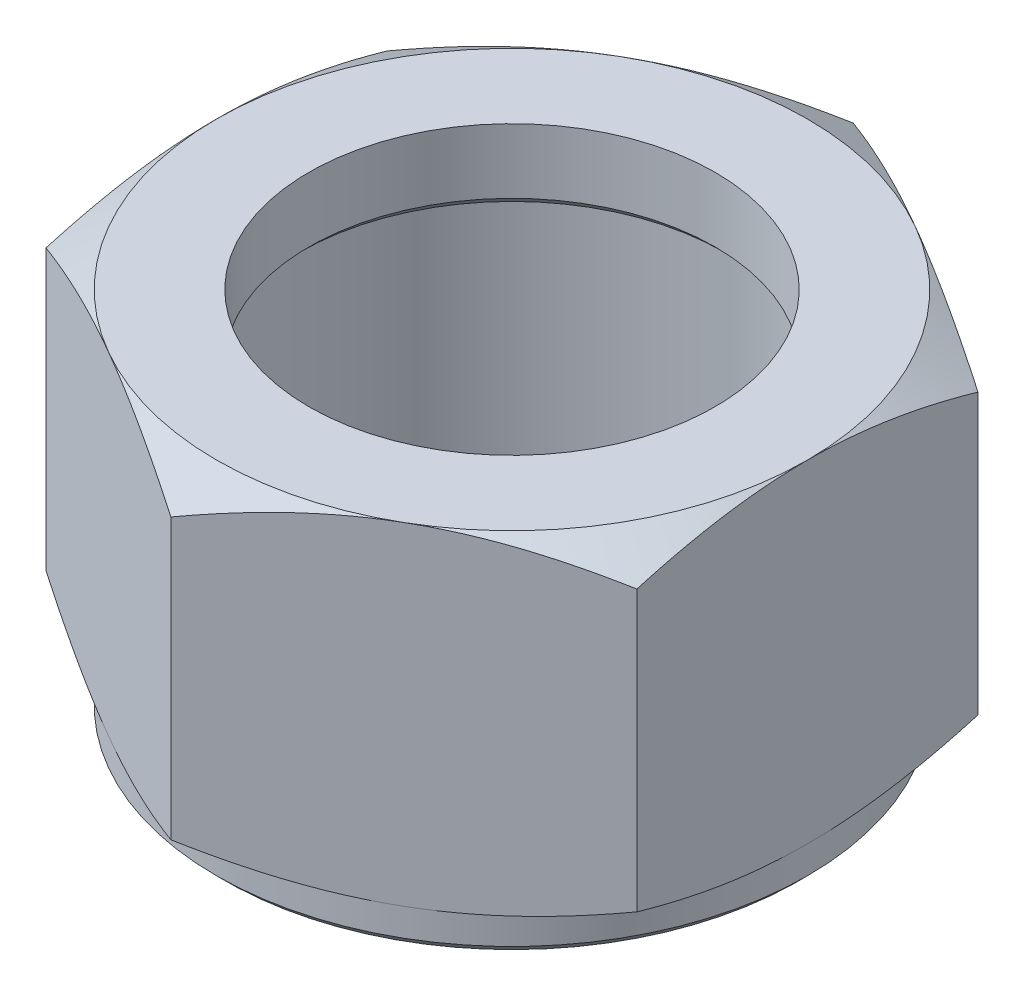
ISO-10303-21;
HEADER;
FILE_DESCRIPTION(('STEP AP214'),'2;1');
FILE_NAME('part.step','',(''),(''),'','','');
FILE_SCHEMA(('AUTOMOTIVE_DESIGN { 1 0 10303 214 1 1 1 1 }'));
ENDSEC;
DATA;
#1=APPLICATION_CONTEXT('core data for automotive mechanical design processes');
#2=APPLICATION_PROTOCOL_DEFINITION('international standard','automotive_design',2000,#1);
#3=PRODUCT_CONTEXT('',#1,'mechanical');
#4=PRODUCT('Part','Part','',(#3));
#5=PRODUCT_RELATED_PRODUCT_CATEGORY('part','',(#4));
#6=PRODUCT_DEFINITION_FORMATION('','',#4);
#7=PRODUCT_DEFINITION_CONTEXT('part definition',#1,'design');
#8=PRODUCT_DEFINITION('design','',#6,#7);
#9=PRODUCT_DEFINITION_SHAPE('','',#8);
#10=(LENGTH_UNIT() NAMED_UNIT(*) SI_UNIT(.MILLI.,.METRE.));
#11=(NAMED_UNIT(*) PLANE_ANGLE_UNIT() SI_UNIT($,.RADIAN.));
#12=(NAMED_UNIT(*) SI_UNIT($,.STERADIAN.) SOLID_ANGLE_UNIT());
#13=UNCERTAINTY_MEASURE_WITH_UNIT(LENGTH_MEASURE(1.E-05),#10,'distance_accuracy_value','');
#14=(GEOMETRIC_REPRESENTATION_CONTEXT(3) GLOBAL_UNCERTAINTY_ASSIGNED_CONTEXT((#13)) GLOBAL_UNIT_ASSIGNED_CONTEXT((#10,
#11,#12)) REPRESENTATION_CONTEXT('',''));
#15=CARTESIAN_POINT('',(0.,0.,0.));
#16=DIRECTION('',(0.,0.,1.));
#17=DIRECTION('',(1.,0.,0.));
#18=AXIS2_PLACEMENT_3D('',#15,#16,#17);
#19=CARTESIAN_POINT('',(16.,18.,-9.23760430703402));
#20=DIRECTION('',(-0.5,0.,0.866025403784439));
#21=DIRECTION('',(0.866025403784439,0.,0.5));
#22=AXIS2_PLACEMENT_3D('',#19,#20,#21);
#23=PLANE('',#22);
#24=CARTESIAN_POINT('',(-0.0002,1.42912902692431,-18.4753240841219));
#25=CARTESIAN_POINT('',(0.351473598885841,1.31191231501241,-18.2722852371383));
#26=CARTESIAN_POINT('',(0.704518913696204,1.20001468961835,-18.0684544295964));
#27=CARTESIAN_POINT('',(1.41344054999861,0.988336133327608,-17.6591583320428));
#28=CARTESIAN_POINT('',(1.76931776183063,0.888559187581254,-17.4536925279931));
#29=CARTESIAN_POINT('',(2.48459095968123,0.702463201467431,-17.04072935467));
#30=CARTESIAN_POINT('',(2.8439932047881,0.616176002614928,-16.8332283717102));
#31=CARTESIAN_POINT('',(3.56529510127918,0.45891234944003,-16.4167845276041));
#32=CARTESIAN_POINT('',(3.92719460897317,0.387935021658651,-16.2078417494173));
#33=CARTESIAN_POINT('',(4.64421780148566,0.264310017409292,-15.793868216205));
#34=CARTESIAN_POINT('',(4.99928825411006,0.211253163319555,-15.5888681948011));
#35=CARTESIAN_POINT('',(5.71105615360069,0.122288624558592,-15.1779288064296));
#36=CARTESIAN_POINT('',(6.06775363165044,0.0863812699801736,-14.9719894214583));
#37=CARTESIAN_POINT('',(6.78174778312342,0.0326223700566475,-14.5597647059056));
#38=CARTESIAN_POINT('',(7.13904323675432,0.0147493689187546,-14.3534800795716));
#39=CARTESIAN_POINT('',(7.85396395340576,-0.00255645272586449,-13.9407204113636));
#40=CARTESIAN_POINT('',(8.21158920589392,-0.00198984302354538,-13.7342453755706));
#41=CARTESIAN_POINT('',(8.88016607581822,0.0162954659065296,-13.3482423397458));
#42=CARTESIAN_POINT('',(9.19116534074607,0.0317837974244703,-13.1686868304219));
#43=CARTESIAN_POINT('',(9.81244849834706,0.0764135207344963,-12.809988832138));
#44=CARTESIAN_POINT('',(10.1227323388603,0.105555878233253,-12.6308463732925));
#45=CARTESIAN_POINT('',(10.7424161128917,0.176985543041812,-12.2730717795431));
#46=CARTESIAN_POINT('',(11.0518151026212,0.219283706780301,-12.0944401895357));
#47=CARTESIAN_POINT('',(11.6691625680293,0.316282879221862,-11.7380144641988));
#48=CARTESIAN_POINT('',(11.9771109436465,0.370984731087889,-11.5602203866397));
#49=CARTESIAN_POINT('',(12.9119052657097,0.555078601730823,-11.0205166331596));
#50=CARTESIAN_POINT('',(13.5360442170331,0.702826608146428,-10.6601698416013));
#51=CARTESIAN_POINT('',(14.7750155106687,1.03815403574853,-9.94484943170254));
#52=CARTESIAN_POINT('',(15.3898637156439,1.22565470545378,-9.58986665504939));
#53=CARTESIAN_POINT('',(16.0002,1.42912902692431,-9.23748883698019));
#54=B_SPLINE_CURVE_WITH_KNOTS('',3,(#24,#25,#26,#27,#28,#29,#30,#31,#32,#33,#34,#35,#36,#37,#38,
#39,#40,#41,#42,#43,#44,#45,#46,#47,#48,#49,#50,#51,#52,#53),.UNSPECIFIED.,.F.,.F.,(4,2,2,2,2,2,
2,2,2,2,2,2,2,2,4),(0.,1.26800386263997,2.53642350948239,3.80779337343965,5.07909068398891,
6.31900943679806,7.55895205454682,8.79741774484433,10.0358451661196,11.1139198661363,
12.1920708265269,13.2711138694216,14.350230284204,16.5559177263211,18.7572757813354),.UNSPECIFIED.);
#55=CARTESIAN_POINT('',(0.,1.42906235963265,-18.475208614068));
#56=VERTEX_POINT('',#55);
#57=CARTESIAN_POINT('',(8.00000000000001,0.,-13.856406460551));
#58=VERTEX_POINT('',#57);
#59=EDGE_CURVE('E141',#56,#58,#54,.T.);
#60=ORIENTED_EDGE('',*,*,#59,.F.);
#61=DIRECTION('',(0.,-1.,0.));
#62=VECTOR('',#61,1.);
#63=CARTESIAN_POINT('',(0.,18.,-18.475208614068));
#64=LINE('',#63,#62);
#65=CARTESIAN_POINT('',(0.,16.5709376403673,-18.475208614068));
#66=VERTEX_POINT('',#65);
#67=EDGE_CURVE('E296',#66,#56,#64,.T.);
#68=ORIENTED_EDGE('',*,*,#67,.F.);
#69=CARTESIAN_POINT('',(16.0002,16.5708709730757,-9.23748883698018));
#70=CARTESIAN_POINT('',(15.6485264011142,16.6880876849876,-9.44052768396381));
#71=CARTESIAN_POINT('',(15.2954810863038,16.7999853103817,-9.64435849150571));
#72=CARTESIAN_POINT('',(14.5865594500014,17.0116638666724,-10.0536545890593));
#73=CARTESIAN_POINT('',(14.2306822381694,17.1114408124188,-10.2591203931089));
#74=CARTESIAN_POINT('',(13.5154090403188,17.2975367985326,-10.6720835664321));
#75=CARTESIAN_POINT('',(13.1560067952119,17.3838239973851,-10.8795845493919));
#76=CARTESIAN_POINT('',(12.4347048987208,17.54108765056,-11.296028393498));
#77=CARTESIAN_POINT('',(12.0728053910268,17.6120649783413,-11.5049711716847));
#78=CARTESIAN_POINT('',(11.3557821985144,17.7356899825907,-11.918944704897));
#79=CARTESIAN_POINT('',(11.00071174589,17.7887468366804,-12.123944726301));
#80=CARTESIAN_POINT('',(10.2889438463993,17.8777113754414,-12.5348841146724));
#81=CARTESIAN_POINT('',(9.93224636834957,17.9136187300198,-12.7408234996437));
#82=CARTESIAN_POINT('',(9.21825221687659,17.9673776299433,-13.1530482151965));
#83=CARTESIAN_POINT('',(8.86095676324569,17.9852506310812,-13.3593328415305));
#84=CARTESIAN_POINT('',(8.14603604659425,18.0025564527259,-13.7720925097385));
#85=CARTESIAN_POINT('',(7.78841079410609,18.0019898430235,-13.9785675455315));
#86=CARTESIAN_POINT('',(7.11983392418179,17.9837045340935,-14.3645705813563));
#87=CARTESIAN_POINT('',(6.80883465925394,17.9682162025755,-14.5441260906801));
#88=CARTESIAN_POINT('',(6.18755150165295,17.9235864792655,-14.902824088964));
#89=CARTESIAN_POINT('',(5.87726766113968,17.8944441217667,-15.0819665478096));
#90=CARTESIAN_POINT('',(5.25758388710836,17.8230144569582,-15.439741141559));
#91=CARTESIAN_POINT('',(4.94818489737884,17.7807162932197,-15.6183727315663));
#92=CARTESIAN_POINT('',(4.33083743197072,17.6837171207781,-15.9747984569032));
#93=CARTESIAN_POINT('',(4.02288905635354,17.6290152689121,-16.1525925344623));
#94=CARTESIAN_POINT('',(3.08809473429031,17.4449213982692,-16.6922962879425));
#95=CARTESIAN_POINT('',(2.46395578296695,17.2971733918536,-17.0526430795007));
#96=CARTESIAN_POINT('',(1.22498448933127,16.9618459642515,-17.7679634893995));
#97=CARTESIAN_POINT('',(0.610136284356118,16.7743452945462,-18.1229462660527));
#98=CARTESIAN_POINT('',(-0.00020000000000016,16.5708709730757,-18.4753240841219));
#99=B_SPLINE_CURVE_WITH_KNOTS('',3,(#69,#70,#71,#72,#73,#74,#75,#76,#77,#78,#79,#80,#81,#82,#83,
#84,#85,#86,#87,#88,#89,#90,#91,#92,#93,#94,#95,#96,#97,#98),.UNSPECIFIED.,.F.,.F.,(4,2,2,2,2,2,
2,2,2,2,2,2,2,2,4),(0.,1.26800386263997,2.53642350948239,3.80779337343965,5.07909068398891,
6.31900943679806,7.55895205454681,8.79741774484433,10.0358451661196,11.1139198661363,
12.1920708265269,13.2711138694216,14.350230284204,16.5559177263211,18.7572757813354),.UNSPECIFIED.);
#100=CARTESIAN_POINT('',(8.00000000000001,18.,-13.856406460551));
#101=VERTEX_POINT('',#100);
#102=EDGE_CURVE('E557',#101,#66,#99,.T.);
#103=ORIENTED_EDGE('',*,*,#102,.F.);
#104=CARTESIAN_POINT('',(16.,16.5709376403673,-9.23760430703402));
#105=VERTEX_POINT('',#104);
#106=EDGE_CURVE('E554',#105,#101,#99,.T.);
#107=ORIENTED_EDGE('',*,*,#106,.F.);
#108=DIRECTION('',(0.,-1.,0.));
#109=VECTOR('',#108,1.);
#110=CARTESIAN_POINT('',(16.,18.,-9.23760430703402));
#111=LINE('',#110,#109);
#112=CARTESIAN_POINT('',(16.,1.42906235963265,-9.23760430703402));
#113=VERTEX_POINT('',#112);
#114=EDGE_CURVE('E163',#105,#113,#111,.T.);
#115=ORIENTED_EDGE('',*,*,#114,.T.);
#116=EDGE_CURVE('E149',#58,#113,#54,.T.);
#117=ORIENTED_EDGE('',*,*,#116,.F.);
#118=EDGE_LOOP('',(#60,#68,#103,#107,#115,#117));
#119=FACE_BOUND('',#118,.T.);
#120=ADVANCED_FACE('F39',(#119),#23,.F.);
#121=CARTESIAN_POINT('',(0.,18.,-18.475208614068));
#122=DIRECTION('',(0.5,0.,0.866025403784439));
#123=DIRECTION('',(0.866025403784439,0.,-0.5));
#124=AXIS2_PLACEMENT_3D('',#121,#122,#123);
#125=PLANE('',#124);
#126=CARTESIAN_POINT('',(-16.0002,1.42912902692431,-9.23748883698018));
#127=CARTESIAN_POINT('',(-15.6485264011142,1.3119123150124,-9.44052768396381));
#128=CARTESIAN_POINT('',(-15.2954810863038,1.20001468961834,-9.64435849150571));
#129=CARTESIAN_POINT('',(-14.5865594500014,0.988336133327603,-10.0536545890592));
#130=CARTESIAN_POINT('',(-14.2306822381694,0.888559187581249,-10.2591203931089));
#131=CARTESIAN_POINT('',(-13.5154090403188,0.702463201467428,-10.6720835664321));
#132=CARTESIAN_POINT('',(-13.1560067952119,0.616176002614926,-10.8795845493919));
#133=CARTESIAN_POINT('',(-12.4347048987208,0.458912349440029,-11.296028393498));
#134=CARTESIAN_POINT('',(-12.0728053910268,0.38793502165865,-11.5049711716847));
#135=CARTESIAN_POINT('',(-11.3557821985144,0.264310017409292,-11.918944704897));
#136=CARTESIAN_POINT('',(-11.00071174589,0.211253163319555,-12.123944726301));
#137=CARTESIAN_POINT('',(-10.2889438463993,0.122288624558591,-12.5348841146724));
#138=CARTESIAN_POINT('',(-9.93224636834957,0.0863812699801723,-12.7408234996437));
#139=CARTESIAN_POINT('',(-9.21825221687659,0.0326223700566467,-13.1530482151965));
#140=CARTESIAN_POINT('',(-8.86095676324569,0.014749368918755,-13.3593328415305));
#141=CARTESIAN_POINT('',(-8.14603604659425,-0.00255645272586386,-13.7720925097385));
#142=CARTESIAN_POINT('',(-7.78841079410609,-0.0019898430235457,-13.9785675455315));
#143=CARTESIAN_POINT('',(-7.11983392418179,0.0162954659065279,-14.3645705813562));
#144=CARTESIAN_POINT('',(-6.80883465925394,0.0317837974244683,-14.5441260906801));
#145=CARTESIAN_POINT('',(-6.18755150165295,0.0764135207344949,-14.902824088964));
#146=CARTESIAN_POINT('',(-5.87726766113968,0.105555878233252,-15.0819665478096));
#147=CARTESIAN_POINT('',(-5.25758388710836,0.176985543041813,-15.439741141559));
#148=CARTESIAN_POINT('',(-4.94818489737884,0.219283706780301,-15.6183727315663));
#149=CARTESIAN_POINT('',(-4.33083743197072,0.316282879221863,-15.9747984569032));
#150=CARTESIAN_POINT('',(-4.02288905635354,0.370984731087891,-16.1525925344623));
#151=CARTESIAN_POINT('',(-3.08809473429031,0.555078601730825,-16.6922962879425));
#152=CARTESIAN_POINT('',(-2.46395578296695,0.70282660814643,-17.0526430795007));
#153=CARTESIAN_POINT('',(-1.22498448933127,1.03815403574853,-17.7679634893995));
#154=CARTESIAN_POINT('',(-0.610136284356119,1.22565470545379,-18.1229462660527));
#155=CARTESIAN_POINT('',(0.000199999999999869,1.42912902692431,-18.4753240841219));
#156=B_SPLINE_CURVE_WITH_KNOTS('',3,(#126,#127,#128,#129,#130,#131,#132,#133,#134,#135,#136,
#137,#138,#139,#140,#141,#142,#143,#144,#145,#146,#147,#148,#149,#150,#151,#152,#153,#154,#155),
.UNSPECIFIED.,.F.,.F.,(4,2,2,2,2,2,2,2,2,2,2,2,2,2,4),(0.,1.26800386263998,2.53642350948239,
3.80779337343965,5.07909068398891,6.31900943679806,7.55895205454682,8.79741774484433,
10.0358451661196,11.1139198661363,12.1920708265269,13.2711138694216,14.350230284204,
16.5559177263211,18.7572757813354),.UNSPECIFIED.);
#157=CARTESIAN_POINT('',(-16.,1.42906235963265,-9.23760430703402));
#158=VERTEX_POINT('',#157);
#159=CARTESIAN_POINT('',(-8.00000000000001,0.,-13.856406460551));
#160=VERTEX_POINT('',#159);
#161=EDGE_CURVE('E272',#158,#160,#156,.T.);
#162=ORIENTED_EDGE('',*,*,#161,.F.);
#163=DIRECTION('',(0.,-1.,0.));
#164=VECTOR('',#163,1.);
#165=CARTESIAN_POINT('',(-16.,18.,-9.23760430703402));
#166=LINE('',#165,#164);
#167=CARTESIAN_POINT('',(-16.,16.5709376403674,-9.23760430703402));
#168=VERTEX_POINT('',#167);
#169=EDGE_CURVE('E292',#168,#158,#166,.T.);
#170=ORIENTED_EDGE('',*,*,#169,.F.);
#171=CARTESIAN_POINT('',(0.00020000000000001,16.5708709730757,-18.4753240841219));
#172=CARTESIAN_POINT('',(-0.351473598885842,16.6880876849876,-18.2722852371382));
#173=CARTESIAN_POINT('',(-0.704518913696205,16.7999853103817,-18.0684544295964));
#174=CARTESIAN_POINT('',(-1.41344054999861,17.0116638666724,-17.6591583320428));
#175=CARTESIAN_POINT('',(-1.76931776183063,17.1114408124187,-17.4536925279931));
#176=CARTESIAN_POINT('',(-2.48459095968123,17.2975367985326,-17.04072935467));
#177=CARTESIAN_POINT('',(-2.8439932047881,17.3838239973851,-16.8332283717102));
#178=CARTESIAN_POINT('',(-3.56529510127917,17.54108765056,-16.4167845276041));
#179=CARTESIAN_POINT('',(-3.92719460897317,17.6120649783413,-16.2078417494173));
#180=CARTESIAN_POINT('',(-4.64421780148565,17.7356899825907,-15.793868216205));
#181=CARTESIAN_POINT('',(-4.99928825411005,17.7887468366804,-15.5888681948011));
#182=CARTESIAN_POINT('',(-5.71105615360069,17.8777113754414,-15.1779288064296));
#183=CARTESIAN_POINT('',(-6.06775363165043,17.9136187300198,-14.9719894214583));
#184=CARTESIAN_POINT('',(-6.78174778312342,17.9673776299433,-14.5597647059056));
#185=CARTESIAN_POINT('',(-7.13904323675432,17.9852506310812,-14.3534800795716));
#186=CARTESIAN_POINT('',(-7.85396395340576,18.0025564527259,-13.9407204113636));
#187=CARTESIAN_POINT('',(-8.21158920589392,18.0019898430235,-13.7342453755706));
#188=CARTESIAN_POINT('',(-8.88016607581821,17.9837045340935,-13.3482423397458));
#189=CARTESIAN_POINT('',(-9.19116534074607,17.9682162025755,-13.1686868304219));
#190=CARTESIAN_POINT('',(-9.81244849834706,17.9235864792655,-12.809988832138));
#191=CARTESIAN_POINT('',(-10.1227323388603,17.8944441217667,-12.6308463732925));
#192=CARTESIAN_POINT('',(-10.7424161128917,17.8230144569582,-12.2730717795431));
#193=CARTESIAN_POINT('',(-11.0518151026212,17.7807162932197,-12.0944401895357));
#194=CARTESIAN_POINT('',(-11.6691625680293,17.6837171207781,-11.7380144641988));
#195=CARTESIAN_POINT('',(-11.9771109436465,17.6290152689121,-11.5602203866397));
#196=CARTESIAN_POINT('',(-12.9119052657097,17.4449213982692,-11.0205166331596));
#197=CARTESIAN_POINT('',(-13.5360442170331,17.2971733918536,-10.6601698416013));
#198=CARTESIAN_POINT('',(-14.7750155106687,16.9618459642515,-9.94484943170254));
#199=CARTESIAN_POINT('',(-15.3898637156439,16.7743452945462,-9.58986665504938));
#200=CARTESIAN_POINT('',(-16.0002,16.5708709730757,-9.23748883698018));
#201=B_SPLINE_CURVE_WITH_KNOTS('',3,(#171,#172,#173,#174,#175,#176,#177,#178,#179,#180,#181,
#182,#183,#184,#185,#186,#187,#188,#189,#190,#191,#192,#193,#194,#195,#196,#197,#198,#199,#200),
.UNSPECIFIED.,.F.,.F.,(4,2,2,2,2,2,2,2,2,2,2,2,2,2,4),(0.,1.26800386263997,2.53642350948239,
3.80779337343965,5.07909068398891,6.31900943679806,7.55895205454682,8.79741774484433,
10.0358451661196,11.1139198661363,12.1920708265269,13.2711138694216,14.350230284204,
16.5559177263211,18.7572757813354),.UNSPECIFIED.);
#202=CARTESIAN_POINT('',(-8.00000000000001,18.,-13.856406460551));
#203=VERTEX_POINT('',#202);
#204=EDGE_CURVE('E264',#203,#168,#201,.T.);
#205=ORIENTED_EDGE('',*,*,#204,.F.);
#206=EDGE_CURVE('E559',#66,#203,#201,.T.);
#207=ORIENTED_EDGE('',*,*,#206,.F.);
#208=ORIENTED_EDGE('',*,*,#67,.T.);
#209=EDGE_CURVE('E143',#160,#56,#156,.T.);
#210=ORIENTED_EDGE('',*,*,#209,.F.);
#211=EDGE_LOOP('',(#162,#170,#205,#207,#208,#210));
#212=FACE_BOUND('',#211,.T.);
#213=ADVANCED_FACE('F257',(#212),#125,.F.);
#214=CARTESIAN_POINT('',(-16.,18.,-9.23760430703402));
#215=DIRECTION('',(1.,0.,0.));
#216=DIRECTION('',(0.,0.,-1.));
#217=AXIS2_PLACEMENT_3D('',#214,#215,#216);
#218=PLANE('',#217);
#219=CARTESIAN_POINT('',(-16.,7.83360946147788,-24.8652170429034));
#220=CARTESIAN_POINT('',(-16.,7.6638149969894,-24.5154929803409));
#221=CARTESIAN_POINT('',(-16.,7.49486356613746,-24.1653598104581));
#222=CARTESIAN_POINT('',(-16.,7.15883766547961,-23.4641898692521));
#223=CARTESIAN_POINT('',(-16.,6.991763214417,-23.1131530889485));
#224=CARTESIAN_POINT('',(-16.,6.49359790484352,-22.0584663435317));
#225=CARTESIAN_POINT('',(-16.,6.16561514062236,-21.353342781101));
#226=CARTESIAN_POINT('',(-16.,5.51815907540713,-19.9345821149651));
#227=CARTESIAN_POINT('',(-16.,5.19874133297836,-19.2209195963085));
#228=CARTESIAN_POINT('',(-16.,4.57291002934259,-17.7879346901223));
#229=CARTESIAN_POINT('',(-16.,4.26649585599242,-17.0686125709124));
#230=CARTESIAN_POINT('',(-16.,3.66063236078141,-15.6001866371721));
#231=CARTESIAN_POINT('',(-16.,3.36171367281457,-14.8508627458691));
#232=CARTESIAN_POINT('',(-16.,2.78637321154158,-13.3434636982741));
#233=CARTESIAN_POINT('',(-16.,2.50995395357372,-12.5853875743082));
#234=CARTESIAN_POINT('',(-16.,1.98683181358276,-11.0607025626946));
#235=CARTESIAN_POINT('',(-16.,1.74006933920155,-10.2941142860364));
#236=CARTESIAN_POINT('',(-16.,1.28412829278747,-8.74987182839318));
#237=CARTESIAN_POINT('',(-16.,1.07493794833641,-7.9722211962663));
#238=CARTESIAN_POINT('',(-16.,0.797417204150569,-6.79934815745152));
#239=CARTESIAN_POINT('',(-16.,0.711132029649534,-6.40834872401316));
#240=CARTESIAN_POINT('',(-16.,0.551688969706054,-5.62366852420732));
#241=CARTESIAN_POINT('',(-16.,0.478530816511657,-5.22998781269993));
#242=CARTESIAN_POINT('',(-16.,0.346630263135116,-4.44021441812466));
#243=CARTESIAN_POINT('',(-16.,0.287887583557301,-4.04412178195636));
#244=CARTESIAN_POINT('',(-16.,0.18598767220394,-3.24994008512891));
#245=CARTESIAN_POINT('',(-16.,0.142829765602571,-2.85185111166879));
#246=CARTESIAN_POINT('',(-16.,0.0735005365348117,-2.05945304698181));
#247=CARTESIAN_POINT('',(-16.,0.0471136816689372,-1.66516292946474));
#248=CARTESIAN_POINT('',(-16.,0.0110403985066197,-0.875820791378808));
#249=CARTESIAN_POINT('',(-16.,0.00135369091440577,-0.480768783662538));
#250=CARTESIAN_POINT('',(-16.,-0.00108876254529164,0.309398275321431));
#251=CARTESIAN_POINT('',(-16.,0.00615584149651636,0.704513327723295));
#252=CARTESIAN_POINT('',(-16.,0.0373993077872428,1.49408485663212));
#253=CARTESIAN_POINT('',(-16.,0.0613989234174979,1.88854130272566));
#254=CARTESIAN_POINT('',(-16.,0.138542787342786,2.83460947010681));
#255=CARTESIAN_POINT('',(-16.,0.199528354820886,3.38559311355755));
#256=CARTESIAN_POINT('',(-16.,0.350884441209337,4.48351167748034));
#257=CARTESIAN_POINT('',(-16.,0.441258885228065,5.03044604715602));
#258=CARTESIAN_POINT('',(-16.,0.648178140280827,6.11971437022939));
#259=CARTESIAN_POINT('',(-16.,0.764742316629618,6.66204460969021));
#260=CARTESIAN_POINT('',(-16.,1.02048654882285,7.74128766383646));
#261=CARTESIAN_POINT('',(-16.,1.15966629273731,8.27820055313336));
#262=CARTESIAN_POINT('',(-16.,1.46075561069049,9.359174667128));
#263=CARTESIAN_POINT('',(-16.,1.62312214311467,9.90310773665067));
#264=CARTESIAN_POINT('',(-16.,1.96474996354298,10.985611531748));
#265=CARTESIAN_POINT('',(-16.,2.14401138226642,11.5241822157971));
#266=CARTESIAN_POINT('',(-16.,2.51657356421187,12.5962413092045));
#267=CARTESIAN_POINT('',(-16.,2.70987000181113,13.1297312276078));
#268=CARTESIAN_POINT('',(-16.,3.00862503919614,13.9266335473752));
#269=CARTESIAN_POINT('',(-16.,3.10967781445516,14.1917106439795));
#270=CARTESIAN_POINT('',(-16.,3.31447532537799,14.720823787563));
#271=CARTESIAN_POINT('',(-16.,3.41822006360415,14.9848598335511));
#272=CARTESIAN_POINT('',(-16.,3.70937468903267,15.7158319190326));
#273=CARTESIAN_POINT('',(-16.,3.89942166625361,16.1817184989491));
#274=CARTESIAN_POINT('',(-16.,4.28612805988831,17.1107446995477));
#275=CARTESIAN_POINT('',(-16.,4.48278764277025,17.5738842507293));
#276=CARTESIAN_POINT('',(-16.,4.88180010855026,18.4977498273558));
#277=CARTESIAN_POINT('',(-16.,5.08415349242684,18.9584756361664));
#278=CARTESIAN_POINT('',(-16.,5.49376198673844,19.8777453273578));
#279=CARTESIAN_POINT('',(-16.,5.70101715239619,20.3362891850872));
#280=CARTESIAN_POINT('',(-16.,6.32928348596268,21.709366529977));
#281=CARTESIAN_POINT('',(-16.,6.75664346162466,22.620996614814));
#282=CARTESIAN_POINT('',(-16.,7.62417267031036,24.4380629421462));
#283=CARTESIAN_POINT('',(-16.,8.06434134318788,25.3434994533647));
#284=CARTESIAN_POINT('',(-16.,8.95535693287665,27.1509311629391));
#285=CARTESIAN_POINT('',(-16.,9.40622009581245,28.0529183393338));
#286=CARTESIAN_POINT('',(-16.,10.3158072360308,29.8529233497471));
#287=CARTESIAN_POINT('',(-16.,10.7745312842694,30.7509411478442));
#288=CARTESIAN_POINT('',(-16.,11.6981559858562,32.5435335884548));
#289=CARTESIAN_POINT('',(-16.,12.1630552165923,33.4381089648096));
#290=CARTESIAN_POINT('',(-16.,13.0979396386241,35.2245918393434));
#291=CARTESIAN_POINT('',(-16.,13.5679248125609,36.1164993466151));
#292=CARTESIAN_POINT('',(-16.,14.4602541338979,37.8003234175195));
#293=CARTESIAN_POINT('',(-16.,14.8821651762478,38.5924696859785));
#294=CARTESIAN_POINT('',(-16.,15.7287936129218,40.1752615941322));
#295=CARTESIAN_POINT('',(-16.,16.1535110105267,40.9659072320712));
#296=CARTESIAN_POINT('',(-16.,17.4312886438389,43.3360171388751));
#297=CARTESIAN_POINT('',(-16.,18.2879216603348,44.913555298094));
#298=CARTESIAN_POINT('',(-16.,20.0053852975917,48.0595219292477));
#299=CARTESIAN_POINT('',(-16.,20.8661924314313,49.6279632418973));
#300=CARTESIAN_POINT('',(-16.,22.1614041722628,51.9783372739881));
#301=CARTESIAN_POINT('',(-16.,22.5937910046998,52.7613829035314));
#302=CARTESIAN_POINT('',(-16.,23.4597580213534,54.3268129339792));
#303=CARTESIAN_POINT('',(-16.,23.8933382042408,55.1091973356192));
#304=CARTESIAN_POINT('',(-16.,24.327439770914,55.8912922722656));
#305=B_SPLINE_CURVE_WITH_KNOTS('',3,(#219,#220,#221,#222,#223,#224,#225,#226,#227,#228,#229,
#230,#231,#232,#233,#234,#235,#236,#237,#238,#239,#240,#241,#242,#243,#244,#245,#246,#247,#248,
#249,#250,#251,#252,#253,#254,#255,#256,#257,#258,#259,#260,#261,#262,#263,#264,#265,#266,#267,
#268,#269,#270,#271,#272,#273,#274,#275,#276,#277,#278,#279,#280,#281,#282,#283,#284,#285,#286,
#287,#288,#289,#290,#291,#292,#293,#294,#295,#296,#297,#298,#299,#300,#301,#302,#303,#304),
.UNSPECIFIED.,.F.,.F.,(4,2,2,2,2,2,2,2,2,2,2,2,2,2,2,2,2,2,2,2,2,2,2,2,2,2,2,2,2,2,2,2,2,2,2,2,
2,2,2,2,2,2,4),(0.,1.16628848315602,2.33258860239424,4.6655318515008,7.01108141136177,
9.35652043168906,11.7764817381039,14.1967132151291,16.6119971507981,19.0265229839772,
20.2275589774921,21.4285704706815,22.6295586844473,23.8304948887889,25.0156674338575,
26.2008201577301,27.3859973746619,28.5712278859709,30.2333559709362,31.8957061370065,
33.5592895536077,35.2228500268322,36.9254702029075,38.6281035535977,40.3302143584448,
41.1812595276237,42.032305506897,43.5417152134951,45.0511629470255,46.5607439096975,
48.0703418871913,51.0906801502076,54.1108865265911,57.1360191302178,60.1611790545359,
63.1856537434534,66.2101181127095,68.902609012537,71.5951030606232,76.980427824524,
82.3478141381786,85.0312941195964,87.7147711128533),.UNSPECIFIED.);
#306=CARTESIAN_POINT('',(-16.,1.42906235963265,9.23760430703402));
#307=VERTEX_POINT('',#306);
#308=CARTESIAN_POINT('',(-16.,0.,0.));
#309=VERTEX_POINT('',#308);
#310=EDGE_CURVE('E282',#307,#309,#305,.F.);
#311=ORIENTED_EDGE('',*,*,#310,.F.);
#312=DIRECTION('',(0.,-1.,0.));
#313=VECTOR('',#312,1.);
#314=CARTESIAN_POINT('',(-16.,18.,9.23760430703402));
#315=LINE('',#314,#313);
#316=CARTESIAN_POINT('',(-16.,16.5709376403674,9.23760430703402));
#317=VERTEX_POINT('',#316);
#318=EDGE_CURVE('E297',#317,#307,#315,.T.);
#319=ORIENTED_EDGE('',*,*,#318,.F.);
#320=CARTESIAN_POINT('',(-16.,10.1663905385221,-24.8652170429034));
#321=CARTESIAN_POINT('',(-16.,10.3361850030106,-24.5154929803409));
#322=CARTESIAN_POINT('',(-16.,10.5051364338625,-24.1653598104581));
#323=CARTESIAN_POINT('',(-16.,10.8411623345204,-23.4641898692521));
#324=CARTESIAN_POINT('',(-16.,11.008236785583,-23.1131530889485));
#325=CARTESIAN_POINT('',(-16.,11.5064020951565,-22.0584663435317));
#326=CARTESIAN_POINT('',(-16.,11.8343848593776,-21.353342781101));
#327=CARTESIAN_POINT('',(-16.,12.4818409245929,-19.9345821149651));
#328=CARTESIAN_POINT('',(-16.,12.8012586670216,-19.2209195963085));
#329=CARTESIAN_POINT('',(-16.,13.4270899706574,-17.7879346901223));
#330=CARTESIAN_POINT('',(-16.,13.7335041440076,-17.0686125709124));
#331=CARTESIAN_POINT('',(-16.,14.3393676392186,-15.6001866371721));
#332=CARTESIAN_POINT('',(-16.,14.6382863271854,-14.8508627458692));
#333=CARTESIAN_POINT('',(-16.,15.2136267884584,-13.3434636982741));
#334=CARTESIAN_POINT('',(-16.,15.4900460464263,-12.5853875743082));
#335=CARTESIAN_POINT('',(-16.,16.0131681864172,-11.0607025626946));
#336=CARTESIAN_POINT('',(-16.,16.2599306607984,-10.2941142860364));
#337=CARTESIAN_POINT('',(-16.,16.7158717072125,-8.74987182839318));
#338=CARTESIAN_POINT('',(-16.,16.9250620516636,-7.9722211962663));
#339=CARTESIAN_POINT('',(-16.,17.2025827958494,-6.79934815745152));
#340=CARTESIAN_POINT('',(-16.,17.2888679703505,-6.40834872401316));
#341=CARTESIAN_POINT('',(-16.,17.4483110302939,-5.62366852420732));
#342=CARTESIAN_POINT('',(-16.,17.5214691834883,-5.22998781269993));
#343=CARTESIAN_POINT('',(-16.,17.6533697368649,-4.44021441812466));
#344=CARTESIAN_POINT('',(-16.,17.7121124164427,-4.04412178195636));
#345=CARTESIAN_POINT('',(-16.,17.8140123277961,-3.24994008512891));
#346=CARTESIAN_POINT('',(-16.,17.8571702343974,-2.85185111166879));
#347=CARTESIAN_POINT('',(-16.,17.9264994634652,-2.05945304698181));
#348=CARTESIAN_POINT('',(-16.,17.9528863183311,-1.66516292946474));
#349=CARTESIAN_POINT('',(-16.,17.9889596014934,-0.875820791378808));
#350=CARTESIAN_POINT('',(-16.,17.9986463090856,-0.480768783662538));
#351=CARTESIAN_POINT('',(-16.,18.0010887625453,0.309398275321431));
#352=CARTESIAN_POINT('',(-16.,17.9938441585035,0.704513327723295));
#353=CARTESIAN_POINT('',(-16.,17.9626006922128,1.49408485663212));
#354=CARTESIAN_POINT('',(-16.,17.9386010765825,1.88854130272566));
#355=CARTESIAN_POINT('',(-16.,17.8614572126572,2.83460947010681));
#356=CARTESIAN_POINT('',(-16.,17.8004716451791,3.38559311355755));
#357=CARTESIAN_POINT('',(-16.,17.6491155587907,4.48351167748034));
#358=CARTESIAN_POINT('',(-16.,17.5587411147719,5.03044604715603));
#359=CARTESIAN_POINT('',(-16.,17.3518218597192,6.11971437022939));
#360=CARTESIAN_POINT('',(-16.,17.2352576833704,6.66204460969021));
#361=CARTESIAN_POINT('',(-16.,16.9795134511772,7.74128766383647));
#362=CARTESIAN_POINT('',(-16.,16.8403337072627,8.27820055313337));
#363=CARTESIAN_POINT('',(-16.,16.5392443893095,9.359174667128));
#364=CARTESIAN_POINT('',(-16.,16.3768778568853,9.90310773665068));
#365=CARTESIAN_POINT('',(-16.,16.035250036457,10.985611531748));
#366=CARTESIAN_POINT('',(-16.,15.8559886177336,11.5241822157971));
#367=CARTESIAN_POINT('',(-16.,15.4834264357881,12.5962413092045));
#368=CARTESIAN_POINT('',(-16.,15.2901299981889,13.1297312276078));
#369=CARTESIAN_POINT('',(-16.,14.9913749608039,13.9266335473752));
#370=CARTESIAN_POINT('',(-16.,14.8903221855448,14.1917106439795));
#371=CARTESIAN_POINT('',(-16.,14.685524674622,14.720823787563));
#372=CARTESIAN_POINT('',(-16.,14.5817799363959,14.9848598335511));
#373=CARTESIAN_POINT('',(-16.,14.2906253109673,15.7158319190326));
#374=CARTESIAN_POINT('',(-16.,14.1005783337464,16.1817184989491));
#375=CARTESIAN_POINT('',(-16.,13.7138719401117,17.1107446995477));
#376=CARTESIAN_POINT('',(-16.,13.5172123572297,17.5738842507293));
#377=CARTESIAN_POINT('',(-16.,13.1181998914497,18.4977498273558));
#378=CARTESIAN_POINT('',(-16.,12.9158465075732,18.9584756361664));
#379=CARTESIAN_POINT('',(-16.,12.5062380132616,19.8777453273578));
#380=CARTESIAN_POINT('',(-16.,12.2989828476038,20.3362891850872));
#381=CARTESIAN_POINT('',(-16.,11.6707165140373,21.709366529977));
#382=CARTESIAN_POINT('',(-16.,11.2433565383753,22.620996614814));
#383=CARTESIAN_POINT('',(-16.,10.3758273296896,24.4380629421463));
#384=CARTESIAN_POINT('',(-16.,9.93565865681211,25.3434994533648));
#385=CARTESIAN_POINT('',(-16.,9.04464306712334,27.1509311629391));
#386=CARTESIAN_POINT('',(-16.,8.59377990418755,28.0529183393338));
#387=CARTESIAN_POINT('',(-16.,7.68419276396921,29.8529233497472));
#388=CARTESIAN_POINT('',(-16.,7.22546871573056,30.7509411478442));
#389=CARTESIAN_POINT('',(-16.,6.30184401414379,32.5435335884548));
#390=CARTESIAN_POINT('',(-16.,5.83694478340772,33.4381089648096));
#391=CARTESIAN_POINT('',(-16.,4.9020603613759,35.2245918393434));
#392=CARTESIAN_POINT('',(-16.,4.43207518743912,36.1164993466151));
#393=CARTESIAN_POINT('',(-16.,3.53974586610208,37.8003234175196));
#394=CARTESIAN_POINT('',(-16.,3.11783482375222,38.5924696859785));
#395=CARTESIAN_POINT('',(-16.,2.27120638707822,40.1752615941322));
#396=CARTESIAN_POINT('',(-16.,1.84648898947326,40.9659072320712));
#397=CARTESIAN_POINT('',(-16.,0.568711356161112,43.3360171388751));
#398=CARTESIAN_POINT('',(-16.,-0.287921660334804,44.913555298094));
#399=CARTESIAN_POINT('',(-16.,-2.00538529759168,48.0595219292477));
#400=CARTESIAN_POINT('',(-16.,-2.86619243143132,49.6279632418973));
#401=CARTESIAN_POINT('',(-16.,-4.16140417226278,51.9783372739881));
#402=CARTESIAN_POINT('',(-16.,-4.59379100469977,52.7613829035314));
#403=CARTESIAN_POINT('',(-16.,-5.45975802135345,54.3268129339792));
#404=CARTESIAN_POINT('',(-16.,-5.89333820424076,55.1091973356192));
#405=CARTESIAN_POINT('',(-16.,-6.32743977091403,55.8912922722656));
#406=B_SPLINE_CURVE_WITH_KNOTS('',3,(#320,#321,#322,#323,#324,#325,#326,#327,#328,#329,#330,
#331,#332,#333,#334,#335,#336,#337,#338,#339,#340,#341,#342,#343,#344,#345,#346,#347,#348,#349,
#350,#351,#352,#353,#354,#355,#356,#357,#358,#359,#360,#361,#362,#363,#364,#365,#366,#367,#368,
#369,#370,#371,#372,#373,#374,#375,#376,#377,#378,#379,#380,#381,#382,#383,#384,#385,#386,#387,
#388,#389,#390,#391,#392,#393,#394,#395,#396,#397,#398,#399,#400,#401,#402,#403,#404,#405),
.UNSPECIFIED.,.F.,.F.,(4,2,2,2,2,2,2,2,2,2,2,2,2,2,2,2,2,2,2,2,2,2,2,2,2,2,2,2,2,2,2,2,2,2,2,2,
2,2,2,2,2,2,4),(0.,1.16628848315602,2.33258860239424,4.66553185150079,7.01108141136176,
9.35652043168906,11.7764817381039,14.1967132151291,16.6119971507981,19.0265229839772,
20.2275589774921,21.4285704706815,22.6295586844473,23.8304948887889,25.0156674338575,
26.2008201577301,27.3859973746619,28.5712278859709,30.2333559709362,31.8957061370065,
33.5592895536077,35.2228500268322,36.9254702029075,38.6281035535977,40.3302143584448,
41.1812595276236,42.032305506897,43.5417152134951,45.0511629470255,46.5607439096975,
48.0703418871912,51.0906801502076,54.1108865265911,57.1360191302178,60.1611790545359,
63.1856537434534,66.2101181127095,68.9026090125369,71.5951030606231,76.9804278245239,
82.3478141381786,85.0312941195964,87.7147711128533),.UNSPECIFIED.);
#407=CARTESIAN_POINT('',(-16.,18.,0.));
#408=VERTEX_POINT('',#407);
#409=EDGE_CURVE('E244',#408,#317,#406,.T.);
#410=ORIENTED_EDGE('',*,*,#409,.F.);
#411=EDGE_CURVE('E294',#168,#408,#406,.T.);
#412=ORIENTED_EDGE('',*,*,#411,.F.);
#413=ORIENTED_EDGE('',*,*,#169,.T.);
#414=EDGE_CURVE('E202',#309,#158,#305,.F.);
#415=ORIENTED_EDGE('',*,*,#414,.F.);
#416=EDGE_LOOP('',(#311,#319,#410,#412,#413,#415));
#417=FACE_BOUND('',#416,.T.);
#418=ADVANCED_FACE('F252',(#417),#218,.F.);
#419=CARTESIAN_POINT('',(-16.,18.,9.23760430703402));
#420=DIRECTION('',(0.5,0.,-0.866025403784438));
#421=DIRECTION('',(-0.866025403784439,0.,-0.5));
#422=AXIS2_PLACEMENT_3D('',#419,#420,#421);
#423=PLANE('',#422);
#424=CARTESIAN_POINT('',(0.000199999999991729,1.42912902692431,18.4753240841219));
#425=CARTESIAN_POINT('',(-0.35147359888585,1.31191231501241,18.2722852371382));
#426=CARTESIAN_POINT('',(-0.704518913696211,1.20001468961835,18.0684544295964));
#427=CARTESIAN_POINT('',(-1.41344054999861,0.988336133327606,17.6591583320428));
#428=CARTESIAN_POINT('',(-1.76931776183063,0.888559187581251,17.4536925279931));
#429=CARTESIAN_POINT('',(-2.48459095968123,0.70246320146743,17.04072935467));
#430=CARTESIAN_POINT('',(-2.8439932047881,0.616176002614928,16.8332283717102));
#431=CARTESIAN_POINT('',(-3.56529510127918,0.458912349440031,16.4167845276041));
#432=CARTESIAN_POINT('',(-3.92719460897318,0.387935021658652,16.2078417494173));
#433=CARTESIAN_POINT('',(-4.64421780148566,0.264310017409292,15.793868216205));
#434=CARTESIAN_POINT('',(-4.99928825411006,0.211253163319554,15.5888681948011));
#435=CARTESIAN_POINT('',(-5.71105615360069,0.122288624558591,15.1779288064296));
#436=CARTESIAN_POINT('',(-6.06775363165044,0.0863812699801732,14.9719894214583));
#437=CARTESIAN_POINT('',(-6.78174778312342,0.0326223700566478,14.5597647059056));
#438=CARTESIAN_POINT('',(-7.13904323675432,0.0147493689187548,14.3534800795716));
#439=CARTESIAN_POINT('',(-7.85396395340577,-0.00255645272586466,13.9407204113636));
#440=CARTESIAN_POINT('',(-8.21158920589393,-0.00198984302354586,13.7342453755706));
#441=CARTESIAN_POINT('',(-8.88016607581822,0.016295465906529,13.3482423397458));
#442=CARTESIAN_POINT('',(-9.19116534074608,0.03178379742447,13.1686868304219));
#443=CARTESIAN_POINT('',(-9.81244849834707,0.076413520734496,12.809988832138));
#444=CARTESIAN_POINT('',(-10.1227323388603,0.105555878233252,12.6308463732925));
#445=CARTESIAN_POINT('',(-10.7424161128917,0.176985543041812,12.2730717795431));
#446=CARTESIAN_POINT('',(-11.0518151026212,0.2192837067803,12.0944401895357));
#447=CARTESIAN_POINT('',(-11.6691625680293,0.316282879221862,11.7380144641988));
#448=CARTESIAN_POINT('',(-11.9771109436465,0.37098473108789,11.5602203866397));
#449=CARTESIAN_POINT('',(-12.9119052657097,0.555078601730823,11.0205166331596));
#450=CARTESIAN_POINT('',(-13.5360442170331,0.702826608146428,10.6601698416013));
#451=CARTESIAN_POINT('',(-14.7750155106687,1.03815403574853,9.94484943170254));
#452=CARTESIAN_POINT('',(-15.3898637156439,1.22565470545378,9.58986665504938));
#453=CARTESIAN_POINT('',(-16.0002,1.42912902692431,9.23748883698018));
#454=B_SPLINE_CURVE_WITH_KNOTS('',3,(#424,#425,#426,#427,#428,#429,#430,#431,#432,#433,#434,
#435,#436,#437,#438,#439,#440,#441,#442,#443,#444,#445,#446,#447,#448,#449,#450,#451,#452,#453),
.UNSPECIFIED.,.F.,.F.,(4,2,2,2,2,2,2,2,2,2,2,2,2,2,4),(0.,1.26800386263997,2.53642350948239,
3.80779337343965,5.07909068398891,6.31900943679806,7.55895205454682,8.79741774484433,
10.0358451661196,11.1139198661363,12.1920708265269,13.2711138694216,14.350230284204,
16.5559177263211,18.7572757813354),.UNSPECIFIED.);
#455=CARTESIAN_POINT('',(0.,1.42906235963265,18.475208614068));
#456=VERTEX_POINT('',#455);
#457=CARTESIAN_POINT('',(-8.00000000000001,0.,13.856406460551));
#458=VERTEX_POINT('',#457);
#459=EDGE_CURVE('E178',#456,#458,#454,.T.);
#460=ORIENTED_EDGE('',*,*,#459,.F.);
#461=DIRECTION('',(0.,-1.,0.));
#462=VECTOR('',#461,1.);
#463=CARTESIAN_POINT('',(0.,18.,18.475208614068));
#464=LINE('',#463,#462);
#465=CARTESIAN_POINT('',(0.,16.5709376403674,18.475208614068));
#466=VERTEX_POINT('',#465);
#467=EDGE_CURVE('E301',#466,#456,#464,.T.);
#468=ORIENTED_EDGE('',*,*,#467,.F.);
#469=CARTESIAN_POINT('',(-16.0002,16.5708709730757,9.23748883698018));
#470=CARTESIAN_POINT('',(-15.6485264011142,16.6880876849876,9.4405276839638));
#471=CARTESIAN_POINT('',(-15.2954810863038,16.7999853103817,9.6443584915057));
#472=CARTESIAN_POINT('',(-14.5865594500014,17.0116638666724,10.0536545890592));
#473=CARTESIAN_POINT('',(-14.2306822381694,17.1114408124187,10.2591203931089));
#474=CARTESIAN_POINT('',(-13.5154090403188,17.2975367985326,10.6720835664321));
#475=CARTESIAN_POINT('',(-13.1560067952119,17.3838239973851,10.8795845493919));
#476=CARTESIAN_POINT('',(-12.4347048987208,17.54108765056,11.296028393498));
#477=CARTESIAN_POINT('',(-12.0728053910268,17.6120649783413,11.5049711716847));
#478=CARTESIAN_POINT('',(-11.3557821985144,17.7356899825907,11.918944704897));
#479=CARTESIAN_POINT('',(-11.00071174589,17.7887468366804,12.123944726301));
#480=CARTESIAN_POINT('',(-10.2889438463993,17.8777113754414,12.5348841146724));
#481=CARTESIAN_POINT('',(-9.93224636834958,17.9136187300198,12.7408234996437));
#482=CARTESIAN_POINT('',(-9.2182522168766,17.9673776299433,13.1530482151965));
#483=CARTESIAN_POINT('',(-8.8609567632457,17.9852506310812,13.3593328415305));
#484=CARTESIAN_POINT('',(-8.14603604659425,18.0025564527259,13.7720925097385));
#485=CARTESIAN_POINT('',(-7.78841079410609,18.0019898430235,13.9785675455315));
#486=CARTESIAN_POINT('',(-7.1198339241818,17.9837045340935,14.3645705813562));
#487=CARTESIAN_POINT('',(-6.80883465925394,17.9682162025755,14.5441260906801));
#488=CARTESIAN_POINT('',(-6.18755150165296,17.9235864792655,14.902824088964));
#489=CARTESIAN_POINT('',(-5.87726766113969,17.8944441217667,15.0819665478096));
#490=CARTESIAN_POINT('',(-5.25758388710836,17.8230144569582,15.439741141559));
#491=CARTESIAN_POINT('',(-4.94818489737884,17.7807162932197,15.6183727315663));
#492=CARTESIAN_POINT('',(-4.33083743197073,17.6837171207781,15.9747984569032));
#493=CARTESIAN_POINT('',(-4.02288905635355,17.6290152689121,16.1525925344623));
#494=CARTESIAN_POINT('',(-3.08809473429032,17.4449213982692,16.6922962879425));
#495=CARTESIAN_POINT('',(-2.46395578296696,17.2971733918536,17.0526430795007));
#496=CARTESIAN_POINT('',(-1.22498448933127,16.9618459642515,17.7679634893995));
#497=CARTESIAN_POINT('',(-0.610136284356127,16.7743452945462,18.1229462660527));
#498=CARTESIAN_POINT('',(0.000199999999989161,16.5708709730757,18.4753240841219));
#499=B_SPLINE_CURVE_WITH_KNOTS('',3,(#469,#470,#471,#472,#473,#474,#475,#476,#477,#478,#479,
#480,#481,#482,#483,#484,#485,#486,#487,#488,#489,#490,#491,#492,#493,#494,#495,#496,#497,#498),
.UNSPECIFIED.,.F.,.F.,(4,2,2,2,2,2,2,2,2,2,2,2,2,2,4),(0.,1.26800386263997,2.53642350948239,
3.80779337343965,5.07909068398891,6.31900943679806,7.55895205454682,8.79741774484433,
10.0358451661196,11.1139198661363,12.1920708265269,13.2711138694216,14.350230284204,
16.5559177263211,18.7572757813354),.UNSPECIFIED.);
#500=CARTESIAN_POINT('',(-8.00000000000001,18.,13.856406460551));
#501=VERTEX_POINT('',#500);
#502=EDGE_CURVE('E238',#501,#466,#499,.T.);
#503=ORIENTED_EDGE('',*,*,#502,.F.);
#504=EDGE_CURVE('E243',#317,#501,#499,.T.);
#505=ORIENTED_EDGE('',*,*,#504,.F.);
#506=ORIENTED_EDGE('',*,*,#318,.T.);
#507=EDGE_CURVE('E273',#458,#307,#454,.T.);
#508=ORIENTED_EDGE('',*,*,#507,.F.);
#509=EDGE_LOOP('',(#460,#468,#503,#505,#506,#508));
#510=FACE_BOUND('',#509,.T.);
#511=ADVANCED_FACE('F249',(#510),#423,.F.);
#512=CARTESIAN_POINT('',(0.,18.,18.475208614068));
#513=DIRECTION('',(-0.5,0.,-0.866025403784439));
#514=DIRECTION('',(-0.866025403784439,0.,0.5));
#515=AXIS2_PLACEMENT_3D('',#512,#513,#514);
#516=PLANE('',#515);
#517=CARTESIAN_POINT('',(16.0002,1.42912902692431,9.23748883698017));
#518=CARTESIAN_POINT('',(15.6485264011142,1.3119123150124,9.4405276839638));
#519=CARTESIAN_POINT('',(15.2954810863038,1.20001468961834,9.6443584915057));
#520=CARTESIAN_POINT('',(14.5865594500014,0.988336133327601,10.0536545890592));
#521=CARTESIAN_POINT('',(14.2306822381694,0.888559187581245,10.2591203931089));
#522=CARTESIAN_POINT('',(13.5154090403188,0.702463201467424,10.6720835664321));
#523=CARTESIAN_POINT('',(13.1560067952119,0.616176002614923,10.8795845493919));
#524=CARTESIAN_POINT('',(12.4347048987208,0.458912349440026,11.296028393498));
#525=CARTESIAN_POINT('',(12.0728053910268,0.387935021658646,11.5049711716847));
#526=CARTESIAN_POINT('',(11.3557821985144,0.264310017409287,11.918944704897));
#527=CARTESIAN_POINT('',(11.00071174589,0.211253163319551,12.123944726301));
#528=CARTESIAN_POINT('',(10.2889438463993,0.122288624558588,12.5348841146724));
#529=CARTESIAN_POINT('',(9.93224636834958,0.0863812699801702,12.7408234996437));
#530=CARTESIAN_POINT('',(9.21825221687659,0.0326223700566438,13.1530482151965));
#531=CARTESIAN_POINT('',(8.86095676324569,0.0147493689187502,13.3593328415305));
#532=CARTESIAN_POINT('',(8.14603604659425,-0.00255645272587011,13.7720925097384));
#533=CARTESIAN_POINT('',(7.78841079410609,-0.00198984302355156,13.9785675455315));
#534=CARTESIAN_POINT('',(7.11983392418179,0.0162954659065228,14.3645705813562));
#535=CARTESIAN_POINT('',(6.80883465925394,0.0317837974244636,14.5441260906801));
#536=CARTESIAN_POINT('',(6.18755150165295,0.0764135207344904,14.902824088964));
#537=CARTESIAN_POINT('',(5.87726766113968,0.105555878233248,15.0819665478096));
#538=CARTESIAN_POINT('',(5.25758388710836,0.176985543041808,15.439741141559));
#539=CARTESIAN_POINT('',(4.94818489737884,0.219283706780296,15.6183727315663));
#540=CARTESIAN_POINT('',(4.33083743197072,0.316282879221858,15.9747984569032));
#541=CARTESIAN_POINT('',(4.02288905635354,0.370984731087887,16.1525925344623));
#542=CARTESIAN_POINT('',(3.08809473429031,0.555078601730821,16.6922962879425));
#543=CARTESIAN_POINT('',(2.46395578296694,0.702826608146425,17.0526430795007));
#544=CARTESIAN_POINT('',(1.22498448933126,1.03815403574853,17.7679634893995));
#545=CARTESIAN_POINT('',(0.610136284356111,1.22565470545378,18.1229462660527));
#546=CARTESIAN_POINT('',(-0.00020000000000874,1.42912902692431,18.4753240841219));
#547=B_SPLINE_CURVE_WITH_KNOTS('',3,(#517,#518,#519,#520,#521,#522,#523,#524,#525,#526,#527,
#528,#529,#530,#531,#532,#533,#534,#535,#536,#537,#538,#539,#540,#541,#542,#543,#544,#545,#546),
.UNSPECIFIED.,.F.,.F.,(4,2,2,2,2,2,2,2,2,2,2,2,2,2,4),(0.,1.26800386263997,2.53642350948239,
3.80779337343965,5.07909068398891,6.31900943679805,7.55895205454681,8.79741774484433,
10.0358451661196,11.1139198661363,12.1920708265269,13.2711138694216,14.350230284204,
16.5559177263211,18.7572757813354),.UNSPECIFIED.);
#548=CARTESIAN_POINT('',(16.,1.42906235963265,9.23760430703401));
#549=VERTEX_POINT('',#548);
#550=CARTESIAN_POINT('',(8.00000000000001,0.,13.856406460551));
#551=VERTEX_POINT('',#550);
#552=EDGE_CURVE('E164',#549,#551,#547,.T.);
#553=ORIENTED_EDGE('',*,*,#552,.F.);
#554=DIRECTION('',(0.,-1.,0.));
#555=VECTOR('',#554,1.);
#556=CARTESIAN_POINT('',(16.,18.,9.23760430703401));
#557=LINE('',#556,#555);
#558=CARTESIAN_POINT('',(16.,16.5709376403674,9.23760430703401));
#559=VERTEX_POINT('',#558);
#560=EDGE_CURVE('E551',#559,#549,#557,.T.);
#561=ORIENTED_EDGE('',*,*,#560,.F.);
#562=CARTESIAN_POINT('',(-0.000200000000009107,16.5708709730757,18.4753240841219));
#563=CARTESIAN_POINT('',(0.351473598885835,16.6880876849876,18.2722852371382));
#564=CARTESIAN_POINT('',(0.704518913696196,16.7999853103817,18.0684544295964));
#565=CARTESIAN_POINT('',(1.4134405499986,17.0116638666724,17.6591583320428));
#566=CARTESIAN_POINT('',(1.76931776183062,17.1114408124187,17.4536925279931));
#567=CARTESIAN_POINT('',(2.48459095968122,17.2975367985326,17.04072935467));
#568=CARTESIAN_POINT('',(2.84399320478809,17.3838239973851,16.8332283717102));
#569=CARTESIAN_POINT('',(3.56529510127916,17.54108765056,16.4167845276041));
#570=CARTESIAN_POINT('',(3.92719460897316,17.6120649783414,16.2078417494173));
#571=CARTESIAN_POINT('',(4.64421780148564,17.7356899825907,15.793868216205));
#572=CARTESIAN_POINT('',(4.99928825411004,17.7887468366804,15.5888681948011));
#573=CARTESIAN_POINT('',(5.71105615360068,17.8777113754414,15.1779288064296));
#574=CARTESIAN_POINT('',(6.06775363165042,17.9136187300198,14.9719894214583));
#575=CARTESIAN_POINT('',(6.78174778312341,17.9673776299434,14.5597647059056));
#576=CARTESIAN_POINT('',(7.13904323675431,17.9852506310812,14.3534800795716));
#577=CARTESIAN_POINT('',(7.85396395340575,18.0025564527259,13.9407204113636));
#578=CARTESIAN_POINT('',(8.21158920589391,18.0019898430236,13.7342453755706));
#579=CARTESIAN_POINT('',(8.8801660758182,17.9837045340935,13.3482423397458));
#580=CARTESIAN_POINT('',(9.19116534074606,17.9682162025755,13.1686868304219));
#581=CARTESIAN_POINT('',(9.81244849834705,17.9235864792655,12.809988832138));
#582=CARTESIAN_POINT('',(10.1227323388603,17.8944441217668,12.6308463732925));
#583=CARTESIAN_POINT('',(10.7424161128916,17.8230144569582,12.2730717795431));
#584=CARTESIAN_POINT('',(11.0518151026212,17.7807162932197,12.0944401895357));
#585=CARTESIAN_POINT('',(11.6691625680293,17.6837171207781,11.7380144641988));
#586=CARTESIAN_POINT('',(11.9771109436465,17.6290152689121,11.5602203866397));
#587=CARTESIAN_POINT('',(12.9119052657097,17.4449213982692,11.0205166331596));
#588=CARTESIAN_POINT('',(13.5360442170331,17.2971733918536,10.6601698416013));
#589=CARTESIAN_POINT('',(14.7750155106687,16.9618459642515,9.94484943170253));
#590=CARTESIAN_POINT('',(15.3898637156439,16.7743452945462,9.58986665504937));
#591=CARTESIAN_POINT('',(16.0002,16.5708709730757,9.23748883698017));
#592=B_SPLINE_CURVE_WITH_KNOTS('',3,(#562,#563,#564,#565,#566,#567,#568,#569,#570,#571,#572,
#573,#574,#575,#576,#577,#578,#579,#580,#581,#582,#583,#584,#585,#586,#587,#588,#589,#590,#591),
.UNSPECIFIED.,.F.,.F.,(4,2,2,2,2,2,2,2,2,2,2,2,2,2,4),(0.,1.26800386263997,2.53642350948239,
3.80779337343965,5.07909068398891,6.31900943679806,7.55895205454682,8.79741774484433,
10.0358451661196,11.1139198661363,12.1920708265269,13.2711138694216,14.350230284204,
16.5559177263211,18.7572757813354),.UNSPECIFIED.);
#593=CARTESIAN_POINT('',(8.00000000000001,18.,13.856406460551));
#594=VERTEX_POINT('',#593);
#595=EDGE_CURVE('E232',#594,#559,#592,.T.);
#596=ORIENTED_EDGE('',*,*,#595,.F.);
#597=EDGE_CURVE('E237',#466,#594,#592,.T.);
#598=ORIENTED_EDGE('',*,*,#597,.F.);
#599=ORIENTED_EDGE('',*,*,#467,.T.);
#600=EDGE_CURVE('E148',#551,#456,#547,.T.);
#601=ORIENTED_EDGE('',*,*,#600,.F.);
#602=EDGE_LOOP('',(#553,#561,#596,#598,#599,#601));
#603=FACE_BOUND('',#602,.T.);
#604=ADVANCED_FACE('F220',(#603),#516,.F.);
#605=CARTESIAN_POINT('',(16.,18.,9.23760430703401));
#606=DIRECTION('',(-1.,0.,0.));
#607=DIRECTION('',(0.,0.,1.));
#608=AXIS2_PLACEMENT_3D('',#605,#606,#607);
#609=PLANE('',#608);
#610=CARTESIAN_POINT('',(16.,7.83360946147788,-24.8652170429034));
#611=CARTESIAN_POINT('',(16.,7.6638149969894,-24.5154929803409));
#612=CARTESIAN_POINT('',(16.,7.49486356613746,-24.1653598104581));
#613=CARTESIAN_POINT('',(16.,7.15883766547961,-23.4641898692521));
#614=CARTESIAN_POINT('',(16.,6.991763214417,-23.1131530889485));
#615=CARTESIAN_POINT('',(16.,6.49359790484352,-22.0584663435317));
#616=CARTESIAN_POINT('',(16.,6.16561514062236,-21.353342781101));
#617=CARTESIAN_POINT('',(16.,5.51815907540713,-19.9345821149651));
#618=CARTESIAN_POINT('',(16.,5.19874133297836,-19.2209195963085));
#619=CARTESIAN_POINT('',(16.,4.57291002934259,-17.7879346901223));
#620=CARTESIAN_POINT('',(16.,4.26649585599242,-17.0686125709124));
#621=CARTESIAN_POINT('',(16.,3.66063236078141,-15.6001866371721));
#622=CARTESIAN_POINT('',(16.,3.36171367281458,-14.8508627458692));
#623=CARTESIAN_POINT('',(16.,2.78637321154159,-13.3434636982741));
#624=CARTESIAN_POINT('',(16.,2.50995395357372,-12.5853875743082));
#625=CARTESIAN_POINT('',(16.,1.98683181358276,-11.0607025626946));
#626=CARTESIAN_POINT('',(16.,1.74006933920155,-10.2941142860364));
#627=CARTESIAN_POINT('',(16.,1.28412829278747,-8.74987182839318));
#628=CARTESIAN_POINT('',(16.,1.07493794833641,-7.9722211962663));
#629=CARTESIAN_POINT('',(16.,0.797417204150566,-6.79934815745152));
#630=CARTESIAN_POINT('',(16.,0.711132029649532,-6.40834872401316));
#631=CARTESIAN_POINT('',(16.,0.551688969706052,-5.62366852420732));
#632=CARTESIAN_POINT('',(16.,0.478530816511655,-5.22998781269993));
#633=CARTESIAN_POINT('',(16.,0.346630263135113,-4.44021441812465));
#634=CARTESIAN_POINT('',(16.,0.287887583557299,-4.04412178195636));
#635=CARTESIAN_POINT('',(16.,0.185987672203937,-3.24994008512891));
#636=CARTESIAN_POINT('',(16.,0.142829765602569,-2.85185111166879));
#637=CARTESIAN_POINT('',(16.,0.0735005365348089,-2.05945304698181));
#638=CARTESIAN_POINT('',(16.,0.0471136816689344,-1.66516292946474));
#639=CARTESIAN_POINT('',(16.,0.0110403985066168,-0.875820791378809));
#640=CARTESIAN_POINT('',(16.,0.00135369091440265,-0.480768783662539));
#641=CARTESIAN_POINT('',(16.,-0.0010887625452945,0.309398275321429));
#642=CARTESIAN_POINT('',(16.,0.0061558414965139,0.704513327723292));
#643=CARTESIAN_POINT('',(16.,0.0373993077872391,1.49408485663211));
#644=CARTESIAN_POINT('',(16.,0.0613989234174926,1.88854130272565));
#645=CARTESIAN_POINT('',(16.,0.13854278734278,2.83460947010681));
#646=CARTESIAN_POINT('',(16.,0.199528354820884,3.38559311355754));
#647=CARTESIAN_POINT('',(16.,0.350884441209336,4.48351167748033));
#648=CARTESIAN_POINT('',(16.,0.441258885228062,5.03044604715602));
#649=CARTESIAN_POINT('',(16.,0.648178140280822,6.11971437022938));
#650=CARTESIAN_POINT('',(16.,0.764742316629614,6.66204460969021));
#651=CARTESIAN_POINT('',(16.,1.02048654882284,7.74128766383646));
#652=CARTESIAN_POINT('',(16.,1.15966629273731,8.27820055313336));
#653=CARTESIAN_POINT('',(16.,1.46075561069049,9.359174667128));
#654=CARTESIAN_POINT('',(16.,1.62312214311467,9.90310773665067));
#655=CARTESIAN_POINT('',(16.,1.96474996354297,10.985611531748));
#656=CARTESIAN_POINT('',(16.,2.14401138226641,11.524182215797));
#657=CARTESIAN_POINT('',(16.,2.51657356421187,12.5962413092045));
#658=CARTESIAN_POINT('',(16.,2.70987000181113,13.1297312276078));
#659=CARTESIAN_POINT('',(16.,3.00862503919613,13.9266335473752));
#660=CARTESIAN_POINT('',(16.,3.10967781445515,14.1917106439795));
#661=CARTESIAN_POINT('',(16.,3.31447532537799,14.720823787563));
#662=CARTESIAN_POINT('',(16.,3.41822006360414,14.984859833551));
#663=CARTESIAN_POINT('',(16.,3.70937468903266,15.7158319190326));
#664=CARTESIAN_POINT('',(16.,3.8994216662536,16.1817184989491));
#665=CARTESIAN_POINT('',(16.,4.2861280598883,17.1107446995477));
#666=CARTESIAN_POINT('',(16.,4.48278764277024,17.5738842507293));
#667=CARTESIAN_POINT('',(16.,4.88180010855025,18.4977498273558));
#668=CARTESIAN_POINT('',(16.,5.08415349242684,18.9584756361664));
#669=CARTESIAN_POINT('',(16.,5.49376198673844,19.8777453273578));
#670=CARTESIAN_POINT('',(16.,5.70101715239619,20.3362891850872));
#671=CARTESIAN_POINT('',(16.,6.32928348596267,21.709366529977));
#672=CARTESIAN_POINT('',(16.,6.75664346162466,22.620996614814));
#673=CARTESIAN_POINT('',(16.,7.62417267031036,24.4380629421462));
#674=CARTESIAN_POINT('',(16.,8.06434134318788,25.3434994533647));
#675=CARTESIAN_POINT('',(16.,8.95535693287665,27.1509311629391));
#676=CARTESIAN_POINT('',(16.,9.40622009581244,28.0529183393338));
#677=CARTESIAN_POINT('',(16.,10.3158072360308,29.8529233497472));
#678=CARTESIAN_POINT('',(16.,10.7745312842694,30.7509411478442));
#679=CARTESIAN_POINT('',(16.,11.6981559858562,32.5435335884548));
#680=CARTESIAN_POINT('',(16.,12.1630552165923,33.4381089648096));
#681=CARTESIAN_POINT('',(16.,13.0979396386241,35.2245918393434));
#682=CARTESIAN_POINT('',(16.,13.5679248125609,36.1164993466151));
#683=CARTESIAN_POINT('',(16.,14.4602541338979,37.8003234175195));
#684=CARTESIAN_POINT('',(16.,14.8821651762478,38.5924696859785));
#685=CARTESIAN_POINT('',(16.,15.7287936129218,40.1752615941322));
#686=CARTESIAN_POINT('',(16.,16.1535110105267,40.9659072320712));
#687=CARTESIAN_POINT('',(16.,17.4312886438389,43.336017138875));
#688=CARTESIAN_POINT('',(16.,18.2879216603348,44.913555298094));
#689=CARTESIAN_POINT('',(16.,20.0053852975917,48.0595219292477));
#690=CARTESIAN_POINT('',(16.,20.8661924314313,49.6279632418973));
#691=CARTESIAN_POINT('',(16.,22.1614041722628,51.978337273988));
#692=CARTESIAN_POINT('',(16.,22.5937910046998,52.7613829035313));
#693=CARTESIAN_POINT('',(16.,23.4597580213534,54.3268129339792));
#694=CARTESIAN_POINT('',(16.,23.8933382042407,55.1091973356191));
#695=CARTESIAN_POINT('',(16.,24.327439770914,55.8912922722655));
#696=B_SPLINE_CURVE_WITH_KNOTS('',3,(#610,#611,#612,#613,#614,#615,#616,#617,#618,#619,#620,
#621,#622,#623,#624,#625,#626,#627,#628,#629,#630,#631,#632,#633,#634,#635,#636,#637,#638,#639,
#640,#641,#642,#643,#644,#645,#646,#647,#648,#649,#650,#651,#652,#653,#654,#655,#656,#657,#658,
#659,#660,#661,#662,#663,#664,#665,#666,#667,#668,#669,#670,#671,#672,#673,#674,#675,#676,#677,
#678,#679,#680,#681,#682,#683,#684,#685,#686,#687,#688,#689,#690,#691,#692,#693,#694,#695),
.UNSPECIFIED.,.F.,.F.,(4,2,2,2,2,2,2,2,2,2,2,2,2,2,2,2,2,2,2,2,2,2,2,2,2,2,2,2,2,2,2,2,2,2,2,2,
2,2,2,2,2,2,4),(0.,1.16628848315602,2.33258860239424,4.66553185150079,7.01108141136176,
9.35652043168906,11.7764817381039,14.1967132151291,16.6119971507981,19.0265229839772,
20.2275589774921,21.4285704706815,22.6295586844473,23.8304948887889,25.0156674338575,
26.2008201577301,27.3859973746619,28.5712278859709,30.2333559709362,31.8957061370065,
33.5592895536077,35.2228500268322,36.9254702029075,38.6281035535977,40.3302143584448,
41.1812595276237,42.032305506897,43.5417152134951,45.0511629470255,46.5607439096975,
48.0703418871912,51.0906801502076,54.1108865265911,57.1360191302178,60.1611790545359,
63.1856537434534,66.2101181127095,68.902609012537,71.5951030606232,76.980427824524,
82.3478141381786,85.0312941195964,87.7147711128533),.UNSPECIFIED.);
#697=CARTESIAN_POINT('',(16.,0.,0.));
#698=VERTEX_POINT('',#697);
#699=EDGE_CURVE('E155',#113,#698,#696,.T.);
#700=ORIENTED_EDGE('',*,*,#699,.F.);
#701=ORIENTED_EDGE('',*,*,#114,.F.);
#702=CARTESIAN_POINT('',(16.,10.1663905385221,-24.8652170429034));
#703=CARTESIAN_POINT('',(16.,10.3361850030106,-24.5154929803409));
#704=CARTESIAN_POINT('',(16.,10.5051364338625,-24.1653598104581));
#705=CARTESIAN_POINT('',(16.,10.8411623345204,-23.4641898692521));
#706=CARTESIAN_POINT('',(16.,11.008236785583,-23.1131530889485));
#707=CARTESIAN_POINT('',(16.,11.5064020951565,-22.0584663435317));
#708=CARTESIAN_POINT('',(16.,11.8343848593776,-21.353342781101));
#709=CARTESIAN_POINT('',(16.,12.4818409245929,-19.9345821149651));
#710=CARTESIAN_POINT('',(16.,12.8012586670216,-19.2209195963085));
#711=CARTESIAN_POINT('',(16.,13.4270899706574,-17.7879346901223));
#712=CARTESIAN_POINT('',(16.,13.7335041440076,-17.0686125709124));
#713=CARTESIAN_POINT('',(16.,14.3393676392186,-15.6001866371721));
#714=CARTESIAN_POINT('',(16.,14.6382863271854,-14.8508627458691));
#715=CARTESIAN_POINT('',(16.,15.2136267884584,-13.3434636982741));
#716=CARTESIAN_POINT('',(16.,15.4900460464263,-12.5853875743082));
#717=CARTESIAN_POINT('',(16.,16.0131681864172,-11.0607025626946));
#718=CARTESIAN_POINT('',(16.,16.2599306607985,-10.2941142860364));
#719=CARTESIAN_POINT('',(16.,16.7158717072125,-8.74987182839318));
#720=CARTESIAN_POINT('',(16.,16.9250620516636,-7.9722211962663));
#721=CARTESIAN_POINT('',(16.,17.2025827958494,-6.79934815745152));
#722=CARTESIAN_POINT('',(16.,17.2888679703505,-6.40834872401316));
#723=CARTESIAN_POINT('',(16.,17.4483110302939,-5.62366852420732));
#724=CARTESIAN_POINT('',(16.,17.5214691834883,-5.22998781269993));
#725=CARTESIAN_POINT('',(16.,17.6533697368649,-4.44021441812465));
#726=CARTESIAN_POINT('',(16.,17.7121124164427,-4.04412178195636));
#727=CARTESIAN_POINT('',(16.,17.8140123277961,-3.24994008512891));
#728=CARTESIAN_POINT('',(16.,17.8571702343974,-2.85185111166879));
#729=CARTESIAN_POINT('',(16.,17.9264994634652,-2.05945304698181));
#730=CARTESIAN_POINT('',(16.,17.9528863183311,-1.66516292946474));
#731=CARTESIAN_POINT('',(16.,17.9889596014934,-0.87582079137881));
#732=CARTESIAN_POINT('',(16.,17.9986463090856,-0.48076878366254));
#733=CARTESIAN_POINT('',(16.,18.0010887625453,0.309398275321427));
#734=CARTESIAN_POINT('',(16.,17.9938441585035,0.70451332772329));
#735=CARTESIAN_POINT('',(16.,17.9626006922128,1.49408485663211));
#736=CARTESIAN_POINT('',(16.,17.9386010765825,1.88854130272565));
#737=CARTESIAN_POINT('',(16.,17.8614572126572,2.83460947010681));
#738=CARTESIAN_POINT('',(16.,17.8004716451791,3.38559311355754));
#739=CARTESIAN_POINT('',(16.,17.6491155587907,4.48351167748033));
#740=CARTESIAN_POINT('',(16.,17.5587411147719,5.03044604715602));
#741=CARTESIAN_POINT('',(16.,17.3518218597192,6.11971437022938));
#742=CARTESIAN_POINT('',(16.,17.2352576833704,6.66204460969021));
#743=CARTESIAN_POINT('',(16.,16.9795134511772,7.74128766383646));
#744=CARTESIAN_POINT('',(16.,16.8403337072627,8.27820055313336));
#745=CARTESIAN_POINT('',(16.,16.5392443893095,9.35917466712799));
#746=CARTESIAN_POINT('',(16.,16.3768778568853,9.90310773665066));
#747=CARTESIAN_POINT('',(16.,16.035250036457,10.985611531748));
#748=CARTESIAN_POINT('',(16.,15.8559886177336,11.524182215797));
#749=CARTESIAN_POINT('',(16.,15.4834264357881,12.5962413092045));
#750=CARTESIAN_POINT('',(16.,15.2901299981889,13.1297312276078));
#751=CARTESIAN_POINT('',(16.,14.9913749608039,13.9266335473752));
#752=CARTESIAN_POINT('',(16.,14.8903221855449,14.1917106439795));
#753=CARTESIAN_POINT('',(16.,14.685524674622,14.720823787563));
#754=CARTESIAN_POINT('',(16.,14.5817799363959,14.984859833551));
#755=CARTESIAN_POINT('',(16.,14.2906253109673,15.7158319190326));
#756=CARTESIAN_POINT('',(16.,14.1005783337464,16.181718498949));
#757=CARTESIAN_POINT('',(16.,13.7138719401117,17.1107446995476));
#758=CARTESIAN_POINT('',(16.,13.5172123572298,17.5738842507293));
#759=CARTESIAN_POINT('',(16.,13.1181998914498,18.4977498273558));
#760=CARTESIAN_POINT('',(16.,12.9158465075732,18.9584756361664));
#761=CARTESIAN_POINT('',(16.,12.5062380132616,19.8777453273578));
#762=CARTESIAN_POINT('',(16.,12.2989828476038,20.3362891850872));
#763=CARTESIAN_POINT('',(16.,11.6707165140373,21.709366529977));
#764=CARTESIAN_POINT('',(16.,11.2433565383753,22.620996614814));
#765=CARTESIAN_POINT('',(16.,10.3758273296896,24.4380629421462));
#766=CARTESIAN_POINT('',(16.,9.93565865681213,25.3434994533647));
#767=CARTESIAN_POINT('',(16.,9.04464306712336,27.1509311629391));
#768=CARTESIAN_POINT('',(16.,8.59377990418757,28.0529183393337));
#769=CARTESIAN_POINT('',(16.,7.68419276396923,29.8529233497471));
#770=CARTESIAN_POINT('',(16.,7.22546871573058,30.7509411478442));
#771=CARTESIAN_POINT('',(16.,6.30184401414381,32.5435335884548));
#772=CARTESIAN_POINT('',(16.,5.83694478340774,33.4381089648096));
#773=CARTESIAN_POINT('',(16.,4.90206036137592,35.2245918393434));
#774=CARTESIAN_POINT('',(16.,4.43207518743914,36.116499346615));
#775=CARTESIAN_POINT('',(16.,3.5397458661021,37.8003234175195));
#776=CARTESIAN_POINT('',(16.,3.11783482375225,38.5924696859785));
#777=CARTESIAN_POINT('',(16.,2.27120638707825,40.1752615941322));
#778=CARTESIAN_POINT('',(16.,1.84648898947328,40.9659072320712));
#779=CARTESIAN_POINT('',(16.,0.568711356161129,43.336017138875));
#780=CARTESIAN_POINT('',(16.,-0.287921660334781,44.9135552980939));
#781=CARTESIAN_POINT('',(16.,-2.00538529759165,48.0595219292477));
#782=CARTESIAN_POINT('',(16.,-2.8661924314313,49.6279632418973));
#783=CARTESIAN_POINT('',(16.,-4.16140417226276,51.978337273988));
#784=CARTESIAN_POINT('',(16.,-4.59379100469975,52.7613829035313));
#785=CARTESIAN_POINT('',(16.,-5.45975802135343,54.3268129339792));
#786=CARTESIAN_POINT('',(16.,-5.89333820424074,55.1091973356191));
#787=CARTESIAN_POINT('',(16.,-6.32743977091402,55.8912922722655));
#788=B_SPLINE_CURVE_WITH_KNOTS('',3,(#702,#703,#704,#705,#706,#707,#708,#709,#710,#711,#712,
#713,#714,#715,#716,#717,#718,#719,#720,#721,#722,#723,#724,#725,#726,#727,#728,#729,#730,#731,
#732,#733,#734,#735,#736,#737,#738,#739,#740,#741,#742,#743,#744,#745,#746,#747,#748,#749,#750,
#751,#752,#753,#754,#755,#756,#757,#758,#759,#760,#761,#762,#763,#764,#765,#766,#767,#768,#769,
#770,#771,#772,#773,#774,#775,#776,#777,#778,#779,#780,#781,#782,#783,#784,#785,#786,#787),
.UNSPECIFIED.,.F.,.F.,(4,2,2,2,2,2,2,2,2,2,2,2,2,2,2,2,2,2,2,2,2,2,2,2,2,2,2,2,2,2,2,2,2,2,2,2,
2,2,2,2,2,2,4),(0.,1.16628848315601,2.33258860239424,4.66553185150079,7.01108141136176,
9.35652043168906,11.7764817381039,14.1967132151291,16.6119971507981,19.0265229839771,
20.2275589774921,21.4285704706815,22.6295586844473,23.8304948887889,25.0156674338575,
26.2008201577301,27.3859973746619,28.5712278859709,30.2333559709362,31.8957061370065,
33.5592895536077,35.2228500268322,36.9254702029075,38.6281035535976,40.3302143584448,
41.1812595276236,42.032305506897,43.5417152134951,45.0511629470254,46.5607439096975,
48.0703418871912,51.0906801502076,54.1108865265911,57.1360191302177,60.1611790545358,
63.1856537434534,66.2101181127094,68.9026090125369,71.5951030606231,76.9804278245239,
82.3478141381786,85.0312941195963,87.7147711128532),.UNSPECIFIED.);
#789=CARTESIAN_POINT('',(16.,18.,0.));
#790=VERTEX_POINT('',#789);
#791=EDGE_CURVE('E226',#790,#105,#788,.F.);
#792=ORIENTED_EDGE('',*,*,#791,.F.);
#793=EDGE_CURVE('E231',#559,#790,#788,.F.);
#794=ORIENTED_EDGE('',*,*,#793,.F.);
#795=ORIENTED_EDGE('',*,*,#560,.T.);
#796=EDGE_CURVE('E157',#698,#549,#696,.T.);
#797=ORIENTED_EDGE('',*,*,#796,.F.);
#798=EDGE_LOOP('',(#700,#701,#792,#794,#795,#797));
#799=FACE_BOUND('',#798,.T.);
#800=ADVANCED_FACE('F216',(#799),#609,.F.);
#801=CARTESIAN_POINT('',(0.,18.,0.));
#802=DIRECTION('',(0.,-1.,0.));
#803=DIRECTION('',(0.,0.,1.));
#804=AXIS2_PLACEMENT_3D('',#801,#802,#803);
#805=CONICAL_SURFACE('',#804,16.,1.0471975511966);
#806=ORIENTED_EDGE('',*,*,#502,.T.);
#807=ORIENTED_EDGE('',*,*,#597,.T.);
#808=CARTESIAN_POINT('',(0.,18.,0.));
#809=DIRECTION('',(0.,1.,0.));
#810=DIRECTION('',(0.,0.,1.));
#811=AXIS2_PLACEMENT_3D('',#808,#809,#810);
#812=CIRCLE('',#811,16.);
#813=EDGE_CURVE('E299',#501,#594,#812,.T.);
#814=ORIENTED_EDGE('',*,*,#813,.F.);
#815=EDGE_LOOP('',(#806,#807,#814));
#816=FACE_BOUND('',#815,.T.);
#817=ADVANCED_FACE('F219',(#816),#805,.T.);
#818=ORIENTED_EDGE('',*,*,#409,.T.);
#819=ORIENTED_EDGE('',*,*,#504,.T.);
#820=EDGE_CURVE('E305',#408,#501,#812,.T.);
#821=ORIENTED_EDGE('',*,*,#820,.F.);
#822=EDGE_LOOP('',(#818,#819,#821));
#823=FACE_BOUND('',#822,.T.);
#824=ADVANCED_FACE('F362',(#823),#805,.T.);
#825=ORIENTED_EDGE('',*,*,#204,.T.);
#826=ORIENTED_EDGE('',*,*,#411,.T.);
#827=EDGE_CURVE('E566',#203,#408,#812,.T.);
#828=ORIENTED_EDGE('',*,*,#827,.F.);
#829=EDGE_LOOP('',(#825,#826,#828));
#830=FACE_BOUND('',#829,.T.);
#831=ADVANCED_FACE('F370',(#830),#805,.T.);
#832=ORIENTED_EDGE('',*,*,#102,.T.);
#833=ORIENTED_EDGE('',*,*,#206,.T.);
#834=EDGE_CURVE('E569',#101,#203,#812,.T.);
#835=ORIENTED_EDGE('',*,*,#834,.F.);
#836=EDGE_LOOP('',(#832,#833,#835));
#837=FACE_BOUND('',#836,.T.);
#838=ADVANCED_FACE('F377',(#837),#805,.T.);
#839=ORIENTED_EDGE('',*,*,#106,.T.);
#840=EDGE_CURVE('E306',#790,#101,#812,.T.);
#841=ORIENTED_EDGE('',*,*,#840,.F.);
#842=ORIENTED_EDGE('',*,*,#791,.T.);
#843=EDGE_LOOP('',(#839,#841,#842));
#844=FACE_BOUND('',#843,.T.);
#845=ADVANCED_FACE('F196',(#844),#805,.T.);
#846=ORIENTED_EDGE('',*,*,#595,.T.);
#847=ORIENTED_EDGE('',*,*,#793,.T.);
#848=CARTESIAN_POINT('',(0.,18.,0.));
#849=DIRECTION('',(0.,1.,0.));
#850=DIRECTION('',(0.,0.,1.));
#851=AXIS2_PLACEMENT_3D('',#848,#849,#850);
#852=CIRCLE('',#851,16.);
#853=EDGE_CURVE('E54',#594,#790,#852,.T.);
#854=ORIENTED_EDGE('',*,*,#853,.F.);
#855=EDGE_LOOP('',(#846,#847,#854));
#856=FACE_BOUND('',#855,.T.);
#857=ADVANCED_FACE('F364',(#856),#805,.T.);
#858=CARTESIAN_POINT('',(0.,18.,-18.475208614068));
#859=DIRECTION('',(0.,1.,0.));
#860=DIRECTION('',(0.,0.,1.));
#861=AXIS2_PLACEMENT_3D('',#858,#859,#860);
#862=PLANE('',#861);
#863=CARTESIAN_POINT('',(0.,18.,0.));
#864=DIRECTION('',(0.,1.,0.));
#865=DIRECTION('',(0.,0.,1.));
#866=AXIS2_PLACEMENT_3D('',#863,#864,#865);
#867=CIRCLE('',#866,11.);
#868=CARTESIAN_POINT('',(0.,18.,11.));
#869=VERTEX_POINT('',#868);
#870=EDGE_CURVE('E533',#869,#869,#867,.T.);
#871=ORIENTED_EDGE('',*,*,#870,.F.);
#872=EDGE_LOOP('',(#871));
#873=FACE_BOUND('',#872,.T.);
#874=ORIENTED_EDGE('',*,*,#813,.T.);
#875=ORIENTED_EDGE('',*,*,#853,.T.);
#876=ORIENTED_EDGE('',*,*,#840,.T.);
#877=ORIENTED_EDGE('',*,*,#834,.T.);
#878=ORIENTED_EDGE('',*,*,#827,.T.);
#879=ORIENTED_EDGE('',*,*,#820,.T.);
#880=EDGE_LOOP('',(#874,#875,#876,#877,#878,#879));
#881=FACE_BOUND('',#880,.T.);
#882=ADVANCED_FACE('F222',(#873,#881),#862,.T.);
#883=CARTESIAN_POINT('',(0.,0.,0.));
#884=DIRECTION('',(0.,1.,0.));
#885=DIRECTION('',(0.,0.,-1.));
#886=AXIS2_PLACEMENT_3D('',#883,#884,#885);
#887=CONICAL_SURFACE('',#886,16.,1.0471975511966);
#888=ORIENTED_EDGE('',*,*,#459,.T.);
#889=CARTESIAN_POINT('',(0.,0.,0.));
#890=DIRECTION('',(0.,1.,0.));
#891=DIRECTION('',(0.,0.,1.));
#892=AXIS2_PLACEMENT_3D('',#889,#890,#891);
#893=CIRCLE('',#892,16.);
#894=EDGE_CURVE('E307',#458,#551,#893,.T.);
#895=ORIENTED_EDGE('',*,*,#894,.T.);
#896=ORIENTED_EDGE('',*,*,#600,.T.);
#897=EDGE_LOOP('',(#888,#895,#896));
#898=FACE_BOUND('',#897,.T.);
#899=ADVANCED_FACE('F192',(#898),#887,.T.);
#900=ORIENTED_EDGE('',*,*,#310,.T.);
#901=EDGE_CURVE('E286',#309,#458,#893,.T.);
#902=ORIENTED_EDGE('',*,*,#901,.T.);
#903=ORIENTED_EDGE('',*,*,#507,.T.);
#904=EDGE_LOOP('',(#900,#902,#903));
#905=FACE_BOUND('',#904,.T.);
#906=ADVANCED_FACE('F186',(#905),#887,.T.);
#907=ORIENTED_EDGE('',*,*,#414,.T.);
#908=ORIENTED_EDGE('',*,*,#161,.T.);
#909=EDGE_CURVE('E134',#160,#309,#893,.T.);
#910=ORIENTED_EDGE('',*,*,#909,.T.);
#911=EDGE_LOOP('',(#907,#908,#910));
#912=FACE_BOUND('',#911,.T.);
#913=ADVANCED_FACE('F191',(#912),#887,.T.);
#914=ORIENTED_EDGE('',*,*,#209,.T.);
#915=ORIENTED_EDGE('',*,*,#59,.T.);
#916=EDGE_CURVE('E127',#58,#160,#893,.T.);
#917=ORIENTED_EDGE('',*,*,#916,.T.);
#918=EDGE_LOOP('',(#914,#915,#917));
#919=FACE_BOUND('',#918,.T.);
#920=ADVANCED_FACE('F142',(#919),#887,.T.);
#921=ORIENTED_EDGE('',*,*,#116,.T.);
#922=ORIENTED_EDGE('',*,*,#699,.T.);
#923=CARTESIAN_POINT('',(0.,0.,0.));
#924=DIRECTION('',(0.,-1.,0.));
#925=DIRECTION('',(0.,0.,-1.));
#926=AXIS2_PLACEMENT_3D('',#923,#924,#925);
#927=CIRCLE('',#926,16.);
#928=EDGE_CURVE('E131',#58,#698,#927,.T.);
#929=ORIENTED_EDGE('',*,*,#928,.F.);
#930=EDGE_LOOP('',(#921,#922,#929));
#931=FACE_BOUND('',#930,.T.);
#932=ADVANCED_FACE('F153',(#931),#887,.T.);
#933=ORIENTED_EDGE('',*,*,#552,.T.);
#934=EDGE_CURVE('E138',#551,#698,#893,.T.);
#935=ORIENTED_EDGE('',*,*,#934,.T.);
#936=ORIENTED_EDGE('',*,*,#796,.T.);
#937=EDGE_LOOP('',(#933,#935,#936));
#938=FACE_BOUND('',#937,.T.);
#939=ADVANCED_FACE('F194',(#938),#887,.T.);
#940=CARTESIAN_POINT('',(0.,-2.,0.));
#941=DIRECTION('',(0.,1.,0.));
#942=DIRECTION('',(0.,0.,1.));
#943=AXIS2_PLACEMENT_3D('',#940,#941,#942);
#944=CYLINDRICAL_SURFACE('',#943,16.);
#945=CARTESIAN_POINT('',(0.,-1.5,0.));
#946=DIRECTION('',(0.,-1.,0.));
#947=DIRECTION('',(0.,0.,-1.));
#948=AXIS2_PLACEMENT_3D('',#945,#946,#947);
#949=CIRCLE('',#948,16.);
#950=CARTESIAN_POINT('',(0.,-1.5,-16.));
#951=VERTEX_POINT('',#950);
#952=EDGE_CURVE('E312',#951,#951,#949,.F.);
#953=ORIENTED_EDGE('',*,*,#952,.T.);
#954=EDGE_LOOP('',(#953));
#955=FACE_BOUND('',#954,.T.);
#956=ORIENTED_EDGE('',*,*,#928,.T.);
#957=ORIENTED_EDGE('',*,*,#934,.F.);
#958=ORIENTED_EDGE('',*,*,#894,.F.);
#959=ORIENTED_EDGE('',*,*,#901,.F.);
#960=ORIENTED_EDGE('',*,*,#909,.F.);
#961=ORIENTED_EDGE('',*,*,#916,.F.);
#962=EDGE_LOOP('',(#956,#957,#958,#959,#960,#961));
#963=FACE_BOUND('',#962,.T.);
#964=ADVANCED_FACE('F129',(#955,#963),#944,.T.);
#965=CARTESIAN_POINT('',(0.,-2.,0.));
#966=DIRECTION('',(0.,-1.,0.));
#967=DIRECTION('',(0.,0.,-1.));
#968=AXIS2_PLACEMENT_3D('',#965,#966,#967);
#969=PLANE('',#968);
#970=CARTESIAN_POINT('',(0.,-2.,0.));
#971=DIRECTION('',(0.,-1.,0.));
#972=DIRECTION('',(0.,0.,-1.));
#973=AXIS2_PLACEMENT_3D('',#970,#971,#972);
#974=CIRCLE('',#973,13.);
#975=CARTESIAN_POINT('',(0.,-2.,-13.));
#976=VERTEX_POINT('',#975);
#977=EDGE_CURVE('E532',#976,#976,#974,.T.);
#978=ORIENTED_EDGE('',*,*,#977,.F.);
#979=EDGE_LOOP('',(#978));
#980=FACE_BOUND('',#979,.T.);
#981=CARTESIAN_POINT('',(0.,-2.,0.));
#982=DIRECTION('',(0.,-1.,0.));
#983=DIRECTION('',(0.,0.,-1.));
#984=AXIS2_PLACEMENT_3D('',#981,#982,#983);
#985=CIRCLE('',#984,15.5);
#986=CARTESIAN_POINT('',(0.,-2.,-15.5));
#987=VERTEX_POINT('',#986);
#988=EDGE_CURVE('E309',#987,#987,#985,.T.);
#989=ORIENTED_EDGE('',*,*,#988,.T.);
#990=EDGE_LOOP('',(#989));
#991=FACE_BOUND('',#990,.T.);
#992=ADVANCED_FACE('F437',(#980,#991),#969,.T.);
#993=CARTESIAN_POINT('',(0.,-2.,0.));
#994=DIRECTION('',(0.,1.,0.));
#995=DIRECTION('',(0.,0.,1.));
#996=AXIS2_PLACEMENT_3D('',#993,#994,#995);
#997=CONICAL_SURFACE('',#996,15.5,0.785398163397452);
#998=ORIENTED_EDGE('',*,*,#952,.F.);
#999=EDGE_LOOP('',(#998));
#1000=FACE_BOUND('',#999,.T.);
#1001=ORIENTED_EDGE('',*,*,#988,.F.);
#1002=EDGE_LOOP('',(#1001));
#1003=FACE_BOUND('',#1002,.T.);
#1004=ADVANCED_FACE('F445',(#1000,#1003),#997,.T.);
#1005=CARTESIAN_POINT('',(0.,14.,0.));
#1006=DIRECTION('',(0.,-1.,0.));
#1007=DIRECTION('',(0.,0.,-1.));
#1008=AXIS2_PLACEMENT_3D('',#1005,#1006,#1007);
#1009=CYLINDRICAL_SURFACE('',#1008,13.);
#1010=CARTESIAN_POINT('',(0.,14.,0.));
#1011=DIRECTION('',(0.,-1.,0.));
#1012=DIRECTION('',(0.,0.,-1.));
#1013=AXIS2_PLACEMENT_3D('',#1010,#1011,#1012);
#1014=CIRCLE('',#1013,13.);
#1015=CARTESIAN_POINT('',(0.,14.,-13.));
#1016=VERTEX_POINT('',#1015);
#1017=EDGE_CURVE('E158',#1016,#1016,#1014,.T.);
#1018=ORIENTED_EDGE('',*,*,#1017,.F.);
#1019=EDGE_LOOP('',(#1018));
#1020=FACE_BOUND('',#1019,.T.);
#1021=ORIENTED_EDGE('',*,*,#977,.T.);
#1022=EDGE_LOOP('',(#1021));
#1023=FACE_BOUND('',#1022,.T.);
#1024=ADVANCED_FACE('F451',(#1020,#1023),#1009,.F.);
#1025=CARTESIAN_POINT('',(0.,14.,0.));
#1026=DIRECTION('',(0.,-1.,0.));
#1027=DIRECTION('',(0.,0.,-1.));
#1028=AXIS2_PLACEMENT_3D('',#1025,#1026,#1027);
#1029=PLANE('',#1028);
#1030=CARTESIAN_POINT('',(0.,14.,0.));
#1031=DIRECTION('',(0.,-1.,0.));
#1032=DIRECTION('',(0.,0.,-1.));
#1033=AXIS2_PLACEMENT_3D('',#1030,#1031,#1032);
#1034=CIRCLE('',#1033,11.5);
#1035=CARTESIAN_POINT('',(0.,14.,-11.5));
#1036=VERTEX_POINT('',#1035);
#1037=EDGE_CURVE('E47',#1036,#1036,#1034,.F.);
#1038=ORIENTED_EDGE('',*,*,#1037,.T.);
#1039=EDGE_LOOP('',(#1038));
#1040=FACE_BOUND('',#1039,.T.);
#1041=ORIENTED_EDGE('',*,*,#1017,.T.);
#1042=EDGE_LOOP('',(#1041));
#1043=FACE_BOUND('',#1042,.T.);
#1044=ADVANCED_FACE('F317',(#1040,#1043),#1029,.T.);
#1045=CARTESIAN_POINT('',(0.,-2.001,0.));
#1046=DIRECTION('',(0.,1.,0.));
#1047=DIRECTION('',(0.,0.,1.));
#1048=AXIS2_PLACEMENT_3D('',#1045,#1046,#1047);
#1049=CYLINDRICAL_SURFACE('',#1048,11.);
#1050=CARTESIAN_POINT('',(0.,14.5,0.));
#1051=DIRECTION('',(0.,-1.,0.));
#1052=DIRECTION('',(0.,0.,-1.));
#1053=AXIS2_PLACEMENT_3D('',#1050,#1051,#1052);
#1054=CIRCLE('',#1053,11.);
#1055=CARTESIAN_POINT('',(0.,14.5,-11.));
#1056=VERTEX_POINT('',#1055);
#1057=EDGE_CURVE('E12',#1056,#1056,#1054,.T.);
#1058=ORIENTED_EDGE('',*,*,#1057,.T.);
#1059=EDGE_LOOP('',(#1058));
#1060=FACE_BOUND('',#1059,.T.);
#1061=ORIENTED_EDGE('',*,*,#870,.T.);
#1062=EDGE_LOOP('',(#1061));
#1063=FACE_BOUND('',#1062,.T.);
#1064=ADVANCED_FACE('F321',(#1060,#1063),#1049,.F.);
#1065=CARTESIAN_POINT('',(0.,14.,0.));
#1066=DIRECTION('',(0.,-1.,0.));
#1067=DIRECTION('',(0.,0.,-1.));
#1068=AXIS2_PLACEMENT_3D('',#1065,#1066,#1067);
#1069=CONICAL_SURFACE('',#1068,11.5,0.785398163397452);
#1070=ORIENTED_EDGE('',*,*,#1057,.F.);
#1071=EDGE_LOOP('',(#1070));
#1072=FACE_BOUND('',#1071,.T.);
#1073=ORIENTED_EDGE('',*,*,#1037,.F.);
#1074=EDGE_LOOP('',(#1073));
#1075=FACE_BOUND('',#1074,.T.);
#1076=ADVANCED_FACE('F41',(#1072,#1075),#1069,.F.);
#1077=CLOSED_SHELL('',(#120,#213,#418,#511,#604,#800,#817,#824,#831,#838,#845,#857,#882,#899,
#906,#913,#920,#932,#939,#964,#992,#1004,#1024,#1044,#1064,#1076));
#1078=MANIFOLD_SOLID_BREP('B2',#1077);
#1079=ADVANCED_BREP_SHAPE_REPRESENTATION('',(#18,#1078),#14);
#1080=SHAPE_DEFINITION_REPRESENTATION(#9,#1079);
ENDSEC;
END-ISO-10303-21;
